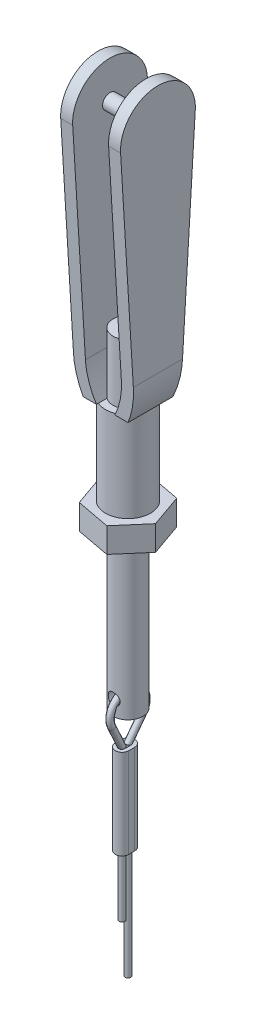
ISO-10303-21;
HEADER;
FILE_DESCRIPTION(('STEP AP214'),'2;1');
FILE_NAME('part.step','',(''),(''),'','','');
FILE_SCHEMA(('AUTOMOTIVE_DESIGN { 1 0 10303 214 1 1 1 1 }'));
ENDSEC;
DATA;
#1=APPLICATION_CONTEXT('core data for automotive mechanical design processes');
#2=APPLICATION_PROTOCOL_DEFINITION('international standard','automotive_design',2000,#1);
#3=PRODUCT_CONTEXT('',#1,'mechanical');
#4=PRODUCT('Part','Part','',(#3));
#5=PRODUCT_RELATED_PRODUCT_CATEGORY('part','',(#4));
#6=PRODUCT_DEFINITION_FORMATION('','',#4);
#7=PRODUCT_DEFINITION_CONTEXT('part definition',#1,'design');
#8=PRODUCT_DEFINITION('design','',#6,#7);
#9=PRODUCT_DEFINITION_SHAPE('','',#8);
#10=(LENGTH_UNIT() NAMED_UNIT(*) SI_UNIT(.MILLI.,.METRE.));
#11=(NAMED_UNIT(*) PLANE_ANGLE_UNIT() SI_UNIT($,.RADIAN.));
#12=(NAMED_UNIT(*) SI_UNIT($,.STERADIAN.) SOLID_ANGLE_UNIT());
#13=UNCERTAINTY_MEASURE_WITH_UNIT(LENGTH_MEASURE(1.E-05),#10,'distance_accuracy_value','');
#14=(GEOMETRIC_REPRESENTATION_CONTEXT(3) GLOBAL_UNCERTAINTY_ASSIGNED_CONTEXT((#13)) GLOBAL_UNIT_ASSIGNED_CONTEXT((#10,
#11,#12)) REPRESENTATION_CONTEXT('',''));
#15=CARTESIAN_POINT('',(0.,0.,0.));
#16=DIRECTION('',(0.,0.,1.));
#17=DIRECTION('',(1.,0.,0.));
#18=AXIS2_PLACEMENT_3D('',#15,#16,#17);
#19=CARTESIAN_POINT('',(1.50530229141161,-7.66,-1.75139896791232));
#20=DIRECTION('',(0.,-1.,0.));
#21=DIRECTION('',(0.,0.,-1.));
#22=AXIS2_PLACEMENT_3D('',#19,#20,#21);
#23=PLANE('',#22);
#24=DIRECTION('',(0.982682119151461,0.,0.185299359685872));
#25=VECTOR('',#24,1.);
#26=CARTESIAN_POINT('',(-0.764104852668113,-7.66,-2.17932950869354));
#27=LINE('',#26,#25);
#28=CARTESIAN_POINT('',(-0.764104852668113,-7.66,-2.17932950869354));
#29=VERTEX_POINT('',#28);
#30=CARTESIAN_POINT('',(1.50530229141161,-7.66,-1.75139896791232));
#31=VERTEX_POINT('',#30);
#32=EDGE_CURVE('E151',#29,#31,#27,.T.);
#33=ORIENTED_EDGE('',*,*,#32,.T.);
#34=DIRECTION('',(0.330867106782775,0.,0.943677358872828));
#35=VECTOR('',#34,1.);
#36=CARTESIAN_POINT('',(1.50530229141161,-7.66,-1.75139896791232));
#37=LINE('',#36,#35);
#38=CARTESIAN_POINT('',(2.26940714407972,-7.66,0.427930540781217));
#39=VERTEX_POINT('',#38);
#40=EDGE_CURVE('E109',#31,#39,#37,.T.);
#41=ORIENTED_EDGE('',*,*,#40,.T.);
#42=DIRECTION('',(-0.651815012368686,0.,0.758377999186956));
#43=VECTOR('',#42,1.);
#44=CARTESIAN_POINT('',(2.26940714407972,-7.66,0.427930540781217));
#45=LINE('',#44,#43);
#46=CARTESIAN_POINT('',(0.764104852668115,-7.66,2.17932950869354));
#47=VERTEX_POINT('',#46);
#48=EDGE_CURVE('E122',#39,#47,#45,.T.);
#49=ORIENTED_EDGE('',*,*,#48,.T.);
#50=DIRECTION('',(-0.982682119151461,0.,-0.185299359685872));
#51=VECTOR('',#50,1.);
#52=CARTESIAN_POINT('',(0.764104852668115,-7.66,2.17932950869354));
#53=LINE('',#52,#51);
#54=CARTESIAN_POINT('',(-1.5053022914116,-7.66,1.75139896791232));
#55=VERTEX_POINT('',#54);
#56=EDGE_CURVE('E116',#47,#55,#53,.T.);
#57=ORIENTED_EDGE('',*,*,#56,.T.);
#58=DIRECTION('',(-0.330867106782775,0.,-0.943677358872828));
#59=VECTOR('',#58,1.);
#60=CARTESIAN_POINT('',(-1.5053022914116,-7.66,1.75139896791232));
#61=LINE('',#60,#59);
#62=CARTESIAN_POINT('',(-2.26940714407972,-7.66,-0.427930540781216));
#63=VERTEX_POINT('',#62);
#64=EDGE_CURVE('E120',#55,#63,#61,.T.);
#65=ORIENTED_EDGE('',*,*,#64,.T.);
#66=DIRECTION('',(0.651815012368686,0.,-0.758377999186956));
#67=VECTOR('',#66,1.);
#68=CARTESIAN_POINT('',(-2.26940714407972,-7.66,-0.427930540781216));
#69=LINE('',#68,#67);
#70=EDGE_CURVE('E72',#63,#29,#69,.T.);
#71=ORIENTED_EDGE('',*,*,#70,.T.);
#72=EDGE_LOOP('',(#33,#41,#49,#57,#65,#71));
#73=FACE_BOUND('',#72,.T.);
#74=CARTESIAN_POINT('',(0.,-7.66,0.));
#75=DIRECTION('',(0.,-1.,0.));
#76=DIRECTION('',(0.,0.,-1.));
#77=AXIS2_PLACEMENT_3D('',#74,#75,#76);
#78=CIRCLE('',#77,1.);
#79=CARTESIAN_POINT('',(0.,-7.66,1.));
#80=VERTEX_POINT('',#79);
#81=EDGE_CURVE('E144',#80,#80,#78,.T.);
#82=ORIENTED_EDGE('',*,*,#81,.F.);
#83=EDGE_LOOP('',(#82));
#84=FACE_BOUND('',#83,.T.);
#85=ADVANCED_FACE('F55',(#73,#84),#23,.T.);
#86=CARTESIAN_POINT('',(1.50530229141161,-6.,-1.75139896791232));
#87=DIRECTION('',(0.,-1.,0.));
#88=DIRECTION('',(0.,0.,-1.));
#89=AXIS2_PLACEMENT_3D('',#86,#87,#88);
#90=PLANE('',#89);
#91=DIRECTION('',(0.982682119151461,0.,0.185299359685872));
#92=VECTOR('',#91,1.);
#93=CARTESIAN_POINT('',(-0.764104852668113,-6.,-2.17932950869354));
#94=LINE('',#93,#92);
#95=CARTESIAN_POINT('',(-0.764104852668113,-6.,-2.17932950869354));
#96=VERTEX_POINT('',#95);
#97=CARTESIAN_POINT('',(1.50530229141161,-6.,-1.75139896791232));
#98=VERTEX_POINT('',#97);
#99=EDGE_CURVE('E140',#96,#98,#94,.T.);
#100=ORIENTED_EDGE('',*,*,#99,.F.);
#101=DIRECTION('',(0.651815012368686,0.,-0.758377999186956));
#102=VECTOR('',#101,1.);
#103=CARTESIAN_POINT('',(-2.26940714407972,-6.,-0.427930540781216));
#104=LINE('',#103,#102);
#105=CARTESIAN_POINT('',(-2.26940714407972,-6.,-0.427930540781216));
#106=VERTEX_POINT('',#105);
#107=EDGE_CURVE('E101',#106,#96,#104,.T.);
#108=ORIENTED_EDGE('',*,*,#107,.F.);
#109=DIRECTION('',(-0.330867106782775,0.,-0.943677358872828));
#110=VECTOR('',#109,1.);
#111=CARTESIAN_POINT('',(-1.5053022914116,-6.,1.75139896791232));
#112=LINE('',#111,#110);
#113=CARTESIAN_POINT('',(-1.5053022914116,-6.,1.75139896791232));
#114=VERTEX_POINT('',#113);
#115=EDGE_CURVE('E95',#114,#106,#112,.T.);
#116=ORIENTED_EDGE('',*,*,#115,.F.);
#117=DIRECTION('',(-0.982682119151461,0.,-0.185299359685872));
#118=VECTOR('',#117,1.);
#119=CARTESIAN_POINT('',(0.764104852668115,-6.,2.17932950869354));
#120=LINE('',#119,#118);
#121=CARTESIAN_POINT('',(0.764104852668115,-6.,2.17932950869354));
#122=VERTEX_POINT('',#121);
#123=EDGE_CURVE('E130',#122,#114,#120,.T.);
#124=ORIENTED_EDGE('',*,*,#123,.F.);
#125=DIRECTION('',(-0.651815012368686,0.,0.758377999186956));
#126=VECTOR('',#125,1.);
#127=CARTESIAN_POINT('',(2.26940714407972,-6.,0.427930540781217));
#128=LINE('',#127,#126);
#129=CARTESIAN_POINT('',(2.26940714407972,-6.,0.427930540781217));
#130=VERTEX_POINT('',#129);
#131=EDGE_CURVE('E146',#130,#122,#128,.T.);
#132=ORIENTED_EDGE('',*,*,#131,.F.);
#133=DIRECTION('',(0.330867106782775,0.,0.943677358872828));
#134=VECTOR('',#133,1.);
#135=CARTESIAN_POINT('',(1.50530229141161,-6.,-1.75139896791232));
#136=LINE('',#135,#134);
#137=EDGE_CURVE('E143',#98,#130,#136,.T.);
#138=ORIENTED_EDGE('',*,*,#137,.F.);
#139=EDGE_LOOP('',(#100,#108,#116,#124,#132,#138));
#140=FACE_BOUND('',#139,.T.);
#141=CARTESIAN_POINT('',(0.,-6.,0.));
#142=DIRECTION('',(0.,-1.,0.));
#143=DIRECTION('',(0.,0.,-1.));
#144=AXIS2_PLACEMENT_3D('',#141,#142,#143);
#145=CIRCLE('',#144,1.);
#146=CARTESIAN_POINT('',(0.,-6.,1.));
#147=VERTEX_POINT('',#146);
#148=EDGE_CURVE('E244',#147,#147,#145,.T.);
#149=ORIENTED_EDGE('',*,*,#148,.T.);
#150=EDGE_LOOP('',(#149));
#151=FACE_BOUND('',#150,.T.);
#152=ADVANCED_FACE('F160',(#140,#151),#90,.F.);
#153=CARTESIAN_POINT('',(-0.764104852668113,-7.66,-2.17932950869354));
#154=DIRECTION('',(-0.185299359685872,0.,0.982682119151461));
#155=DIRECTION('',(0.982682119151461,0.,0.185299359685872));
#156=AXIS2_PLACEMENT_3D('',#153,#154,#155);
#157=PLANE('',#156);
#158=ORIENTED_EDGE('',*,*,#99,.T.);
#159=DIRECTION('',(0.,1.,0.));
#160=VECTOR('',#159,1.);
#161=CARTESIAN_POINT('',(1.50530229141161,-7.66,-1.75139896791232));
#162=LINE('',#161,#160);
#163=EDGE_CURVE('E13',#31,#98,#162,.T.);
#164=ORIENTED_EDGE('',*,*,#163,.F.);
#165=ORIENTED_EDGE('',*,*,#32,.F.);
#166=DIRECTION('',(0.,1.,0.));
#167=VECTOR('',#166,1.);
#168=CARTESIAN_POINT('',(-0.764104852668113,-7.66,-2.17932950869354));
#169=LINE('',#168,#167);
#170=EDGE_CURVE('E136',#29,#96,#169,.T.);
#171=ORIENTED_EDGE('',*,*,#170,.T.);
#172=EDGE_LOOP('',(#158,#164,#165,#171));
#173=FACE_BOUND('',#172,.T.);
#174=ADVANCED_FACE('F57',(#173),#157,.F.);
#175=CARTESIAN_POINT('',(1.50530229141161,-7.66,-1.75139896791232));
#176=DIRECTION('',(-0.943677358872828,0.,0.330867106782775));
#177=DIRECTION('',(0.330867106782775,0.,0.943677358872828));
#178=AXIS2_PLACEMENT_3D('',#175,#176,#177);
#179=PLANE('',#178);
#180=ORIENTED_EDGE('',*,*,#137,.T.);
#181=DIRECTION('',(0.,1.,0.));
#182=VECTOR('',#181,1.);
#183=CARTESIAN_POINT('',(2.26940714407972,-7.66,0.427930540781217));
#184=LINE('',#183,#182);
#185=EDGE_CURVE('E64',#39,#130,#184,.T.);
#186=ORIENTED_EDGE('',*,*,#185,.F.);
#187=ORIENTED_EDGE('',*,*,#40,.F.);
#188=ORIENTED_EDGE('',*,*,#163,.T.);
#189=EDGE_LOOP('',(#180,#186,#187,#188));
#190=FACE_BOUND('',#189,.T.);
#191=ADVANCED_FACE('F185',(#190),#179,.F.);
#192=CARTESIAN_POINT('',(2.26940714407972,-7.66,0.427930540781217));
#193=DIRECTION('',(-0.758377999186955,0.,-0.651815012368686));
#194=DIRECTION('',(-0.651815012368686,0.,0.758377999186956));
#195=AXIS2_PLACEMENT_3D('',#192,#193,#194);
#196=PLANE('',#195);
#197=ORIENTED_EDGE('',*,*,#131,.T.);
#198=DIRECTION('',(0.,1.,0.));
#199=VECTOR('',#198,1.);
#200=CARTESIAN_POINT('',(0.764104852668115,-7.66,2.17932950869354));
#201=LINE('',#200,#199);
#202=EDGE_CURVE('E131',#47,#122,#201,.T.);
#203=ORIENTED_EDGE('',*,*,#202,.F.);
#204=ORIENTED_EDGE('',*,*,#48,.F.);
#205=ORIENTED_EDGE('',*,*,#185,.T.);
#206=EDGE_LOOP('',(#197,#203,#204,#205));
#207=FACE_BOUND('',#206,.T.);
#208=ADVANCED_FACE('F157',(#207),#196,.F.);
#209=CARTESIAN_POINT('',(0.764104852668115,-7.66,2.17932950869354));
#210=DIRECTION('',(0.185299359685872,0.,-0.982682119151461));
#211=DIRECTION('',(-0.982682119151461,0.,-0.185299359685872));
#212=AXIS2_PLACEMENT_3D('',#209,#210,#211);
#213=PLANE('',#212);
#214=ORIENTED_EDGE('',*,*,#123,.T.);
#215=DIRECTION('',(0.,1.,0.));
#216=VECTOR('',#215,1.);
#217=CARTESIAN_POINT('',(-1.5053022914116,-7.66,1.75139896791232));
#218=LINE('',#217,#216);
#219=EDGE_CURVE('E127',#55,#114,#218,.T.);
#220=ORIENTED_EDGE('',*,*,#219,.F.);
#221=ORIENTED_EDGE('',*,*,#56,.F.);
#222=ORIENTED_EDGE('',*,*,#202,.T.);
#223=EDGE_LOOP('',(#214,#220,#221,#222));
#224=FACE_BOUND('',#223,.T.);
#225=ADVANCED_FACE('F128',(#224),#213,.F.);
#226=CARTESIAN_POINT('',(-1.5053022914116,-7.66,1.75139896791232));
#227=DIRECTION('',(0.943677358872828,0.,-0.330867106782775));
#228=DIRECTION('',(-0.330867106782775,0.,-0.943677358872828));
#229=AXIS2_PLACEMENT_3D('',#226,#227,#228);
#230=PLANE('',#229);
#231=ORIENTED_EDGE('',*,*,#115,.T.);
#232=DIRECTION('',(0.,1.,0.));
#233=VECTOR('',#232,1.);
#234=CARTESIAN_POINT('',(-2.26940714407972,-7.66,-0.427930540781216));
#235=LINE('',#234,#233);
#236=EDGE_CURVE('E132',#63,#106,#235,.T.);
#237=ORIENTED_EDGE('',*,*,#236,.F.);
#238=ORIENTED_EDGE('',*,*,#64,.F.);
#239=ORIENTED_EDGE('',*,*,#219,.T.);
#240=EDGE_LOOP('',(#231,#237,#238,#239));
#241=FACE_BOUND('',#240,.T.);
#242=ADVANCED_FACE('F134',(#241),#230,.F.);
#243=CARTESIAN_POINT('',(-2.26940714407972,-7.66,-0.427930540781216));
#244=DIRECTION('',(0.758377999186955,0.,0.651815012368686));
#245=DIRECTION('',(0.651815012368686,0.,-0.758377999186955));
#246=AXIS2_PLACEMENT_3D('',#243,#244,#245);
#247=PLANE('',#246);
#248=ORIENTED_EDGE('',*,*,#107,.T.);
#249=ORIENTED_EDGE('',*,*,#170,.F.);
#250=ORIENTED_EDGE('',*,*,#70,.F.);
#251=ORIENTED_EDGE('',*,*,#236,.T.);
#252=EDGE_LOOP('',(#248,#249,#250,#251));
#253=FACE_BOUND('',#252,.T.);
#254=ADVANCED_FACE('F165',(#253),#247,.F.);
#255=CARTESIAN_POINT('',(0.,-7.66,0.));
#256=DIRECTION('',(0.,1.,0.));
#257=DIRECTION('',(0.,0.,1.));
#258=AXIS2_PLACEMENT_3D('',#255,#256,#257);
#259=CYLINDRICAL_SURFACE('',#258,1.);
#260=CARTESIAN_POINT('',(0.,-7.66,1.));
#261=CARTESIAN_POINT('',(0.,-7.64270833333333,1.));
#262=CARTESIAN_POINT('',(0.,-7.62541666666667,1.));
#263=CARTESIAN_POINT('',(0.,-7.59083333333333,1.));
#264=CARTESIAN_POINT('',(0.,-7.57354166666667,1.));
#265=CARTESIAN_POINT('',(0.,-7.53895833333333,1.));
#266=CARTESIAN_POINT('',(0.,-7.52166666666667,1.));
#267=CARTESIAN_POINT('',(0.,-7.48708333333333,1.));
#268=CARTESIAN_POINT('',(0.,-7.46979166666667,1.));
#269=CARTESIAN_POINT('',(0.,-7.43520833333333,1.));
#270=CARTESIAN_POINT('',(0.,-7.41791666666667,1.));
#271=CARTESIAN_POINT('',(0.,-7.38333333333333,1.));
#272=CARTESIAN_POINT('',(0.,-7.36604166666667,1.));
#273=CARTESIAN_POINT('',(0.,-7.33145833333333,1.));
#274=CARTESIAN_POINT('',(0.,-7.31416666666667,1.));
#275=CARTESIAN_POINT('',(0.,-7.27958333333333,1.));
#276=CARTESIAN_POINT('',(0.,-7.26229166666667,1.));
#277=CARTESIAN_POINT('',(0.,-7.22770833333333,1.));
#278=CARTESIAN_POINT('',(0.,-7.21041666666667,1.));
#279=CARTESIAN_POINT('',(0.,-7.17583333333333,1.));
#280=CARTESIAN_POINT('',(0.,-7.15854166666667,1.));
#281=CARTESIAN_POINT('',(0.,-7.12395833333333,1.));
#282=CARTESIAN_POINT('',(0.,-7.10666666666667,1.));
#283=CARTESIAN_POINT('',(0.,-7.07208333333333,1.));
#284=CARTESIAN_POINT('',(0.,-7.05479166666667,1.));
#285=CARTESIAN_POINT('',(0.,-7.02020833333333,1.));
#286=CARTESIAN_POINT('',(0.,-7.00291666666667,1.));
#287=CARTESIAN_POINT('',(0.,-6.96833333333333,1.));
#288=CARTESIAN_POINT('',(0.,-6.95104166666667,1.));
#289=CARTESIAN_POINT('',(0.,-6.91645833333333,1.));
#290=CARTESIAN_POINT('',(0.,-6.89916666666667,1.));
#291=CARTESIAN_POINT('',(0.,-6.86458333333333,1.));
#292=CARTESIAN_POINT('',(0.,-6.84729166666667,1.));
#293=CARTESIAN_POINT('',(0.,-6.81270833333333,1.));
#294=CARTESIAN_POINT('',(0.,-6.79541666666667,1.));
#295=CARTESIAN_POINT('',(0.,-6.76083333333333,1.));
#296=CARTESIAN_POINT('',(0.,-6.74354166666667,1.));
#297=CARTESIAN_POINT('',(0.,-6.70895833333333,1.));
#298=CARTESIAN_POINT('',(0.,-6.69166666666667,1.));
#299=CARTESIAN_POINT('',(0.,-6.65708333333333,1.));
#300=CARTESIAN_POINT('',(0.,-6.63979166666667,1.));
#301=CARTESIAN_POINT('',(0.,-6.60520833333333,1.));
#302=CARTESIAN_POINT('',(0.,-6.58791666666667,1.));
#303=CARTESIAN_POINT('',(0.,-6.55333333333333,1.));
#304=CARTESIAN_POINT('',(0.,-6.53604166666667,1.));
#305=CARTESIAN_POINT('',(0.,-6.50145833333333,1.));
#306=CARTESIAN_POINT('',(0.,-6.48416666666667,1.));
#307=CARTESIAN_POINT('',(0.,-6.44958333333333,1.));
#308=CARTESIAN_POINT('',(0.,-6.43229166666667,1.));
#309=CARTESIAN_POINT('',(0.,-6.39770833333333,1.));
#310=CARTESIAN_POINT('',(0.,-6.38041666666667,1.));
#311=CARTESIAN_POINT('',(0.,-6.34583333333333,1.));
#312=CARTESIAN_POINT('',(0.,-6.32854166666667,1.));
#313=CARTESIAN_POINT('',(0.,-6.29395833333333,1.));
#314=CARTESIAN_POINT('',(0.,-6.27666666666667,1.));
#315=CARTESIAN_POINT('',(0.,-6.24208333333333,1.));
#316=CARTESIAN_POINT('',(0.,-6.22479166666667,1.));
#317=CARTESIAN_POINT('',(0.,-6.19020833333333,1.));
#318=CARTESIAN_POINT('',(0.,-6.17291666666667,1.));
#319=CARTESIAN_POINT('',(0.,-6.13833333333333,1.));
#320=CARTESIAN_POINT('',(0.,-6.12104166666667,1.));
#321=CARTESIAN_POINT('',(0.,-6.08645833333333,1.));
#322=CARTESIAN_POINT('',(0.,-6.06916666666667,1.));
#323=CARTESIAN_POINT('',(0.,-6.03458333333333,1.));
#324=CARTESIAN_POINT('',(0.,-6.01729166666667,1.));
#325=CARTESIAN_POINT('',(0.,-6.,1.));
#326=B_SPLINE_CURVE_WITH_KNOTS('',3,(#260,#261,#262,#263,#264,#265,#266,#267,#268,#269,#270,
#271,#272,#273,#274,#275,#276,#277,#278,#279,#280,#281,#282,#283,#284,#285,#286,#287,#288,#289,
#290,#291,#292,#293,#294,#295,#296,#297,#298,#299,#300,#301,#302,#303,#304,#305,#306,#307,#308,
#309,#310,#311,#312,#313,#314,#315,#316,#317,#318,#319,#320,#321,#322,#323,#324,#325),
.UNSPECIFIED.,.F.,.F.,(4,2,2,2,2,2,2,2,2,2,2,2,2,2,2,2,2,2,2,2,2,2,2,2,2,2,2,2,2,2,2,2,4),(0.,
0.0518749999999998,0.10375,0.155625,0.207499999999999,0.259374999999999,0.31125,0.363125,0.415,
0.466874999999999,0.518749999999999,0.570625,0.6225,0.674375,0.72625,0.778124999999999,0.83,
0.881875,0.93375,0.985625,1.0375,1.089375,1.14125,1.193125,1.245,1.296875,1.34875,1.400625,
1.4525,1.504375,1.55625,1.608125,1.66),.UNSPECIFIED.);
#327=EDGE_CURVE('BSEAM167',#80,#147,#326,.T.);
#328=ORIENTED_EDGE('',*,*,#81,.T.);
#329=ORIENTED_EDGE('',*,*,#148,.F.);
#330=ORIENTED_EDGE('',*,*,#327,.T.);
#331=ORIENTED_EDGE('',*,*,#327,.F.);
#332=EDGE_LOOP('',(#328,#330,#329,#331));
#333=FACE_BOUND('',#332,.T.);
#334=ADVANCED_FACE('F167',(#333),#259,.F.);
#335=CLOSED_SHELL('',(#85,#152,#174,#191,#208,#225,#242,#254,#334));
#336=MANIFOLD_SOLID_BREP('B2',#335);
#337=CARTESIAN_POINT('',(0.,-26.063324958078,0.4));
#338=DIRECTION('',(0.,-1.,0.));
#339=DIRECTION('',(1.,0.,0.));
#340=AXIS2_PLACEMENT_3D('',#337,#338,#339);
#341=PLANE('',#340);
#342=CARTESIAN_POINT('',(0.,-26.063324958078,0.4));
#343=DIRECTION('',(0.,-1.,0.));
#344=DIRECTION('',(1.,0.,0.));
#345=AXIS2_PLACEMENT_3D('',#342,#343,#344);
#346=CIRCLE('',#345,0.449999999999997);
#347=CARTESIAN_POINT('',(0.450000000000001,-26.063324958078,0.4));
#348=VERTEX_POINT('',#347);
#349=CARTESIAN_POINT('',(-0.449999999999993,-26.063324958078,0.4));
#350=VERTEX_POINT('',#349);
#351=EDGE_CURVE('E363',#348,#350,#346,.T.);
#352=ORIENTED_EDGE('',*,*,#351,.T.);
#353=DIRECTION('',(0.,0.,-1.));
#354=VECTOR('',#353,1.);
#355=CARTESIAN_POINT('',(-0.449999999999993,-26.063324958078,0.4));
#356=LINE('',#355,#354);
#357=CARTESIAN_POINT('',(-0.449999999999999,-26.063324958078,0.));
#358=VERTEX_POINT('',#357);
#359=EDGE_CURVE('E366',#350,#358,#356,.T.);
#360=ORIENTED_EDGE('',*,*,#359,.T.);
#361=CARTESIAN_POINT('',(0.,-26.063324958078,0.));
#362=DIRECTION('',(0.,-1.,0.));
#363=DIRECTION('',(1.,0.,0.));
#364=AXIS2_PLACEMENT_3D('',#361,#362,#363);
#365=CIRCLE('',#364,0.45);
#366=CARTESIAN_POINT('',(0.450000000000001,-26.063324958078,0.));
#367=VERTEX_POINT('',#366);
#368=EDGE_CURVE('E369',#358,#367,#365,.T.);
#369=ORIENTED_EDGE('',*,*,#368,.T.);
#370=DIRECTION('',(0.,0.,1.));
#371=VECTOR('',#370,1.);
#372=CARTESIAN_POINT('',(0.450000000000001,-26.063324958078,0.4));
#373=LINE('',#372,#371);
#374=EDGE_CURVE('E371',#367,#348,#373,.T.);
#375=ORIENTED_EDGE('',*,*,#374,.T.);
#376=EDGE_LOOP('',(#352,#360,#369,#375));
#377=FACE_BOUND('',#376,.T.);
#378=DIRECTION('',(0.,0.,-1.));
#379=VECTOR('',#378,1.);
#380=CARTESIAN_POINT('',(-0.199999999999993,-26.063324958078,0.4));
#381=LINE('',#380,#379);
#382=CARTESIAN_POINT('',(-0.199999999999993,-26.063324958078,0.4));
#383=VERTEX_POINT('',#382);
#384=CARTESIAN_POINT('',(-0.199999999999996,-26.063324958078,0.));
#385=VERTEX_POINT('',#384);
#386=EDGE_CURVE('E335',#383,#385,#381,.T.);
#387=ORIENTED_EDGE('',*,*,#386,.F.);
#388=CARTESIAN_POINT('',(0.,-26.063324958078,0.4));
#389=DIRECTION('',(0.,-1.,0.));
#390=DIRECTION('',(1.,0.,0.));
#391=AXIS2_PLACEMENT_3D('',#388,#389,#390);
#392=CIRCLE('',#391,0.199999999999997);
#393=CARTESIAN_POINT('',(0.200000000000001,-26.063324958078,0.4));
#394=VERTEX_POINT('',#393);
#395=EDGE_CURVE('E327',#394,#383,#392,.T.);
#396=ORIENTED_EDGE('',*,*,#395,.F.);
#397=DIRECTION('',(0.,0.,1.));
#398=VECTOR('',#397,1.);
#399=CARTESIAN_POINT('',(0.200000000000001,-26.063324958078,0.4));
#400=LINE('',#399,#398);
#401=CARTESIAN_POINT('',(0.200000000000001,-26.063324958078,0.));
#402=VERTEX_POINT('',#401);
#403=EDGE_CURVE('E349',#402,#394,#400,.T.);
#404=ORIENTED_EDGE('',*,*,#403,.F.);
#405=CARTESIAN_POINT('',(0.,-26.063324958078,0.));
#406=DIRECTION('',(0.,-1.,0.));
#407=DIRECTION('',(1.,0.,0.));
#408=AXIS2_PLACEMENT_3D('',#405,#406,#407);
#409=CIRCLE('',#408,0.199999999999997);
#410=EDGE_CURVE('E347',#385,#402,#409,.T.);
#411=ORIENTED_EDGE('',*,*,#410,.F.);
#412=EDGE_LOOP('',(#387,#396,#404,#411));
#413=FACE_BOUND('',#412,.T.);
#414=ADVANCED_FACE('F262',(#377,#413),#341,.T.);
#415=CARTESIAN_POINT('',(0.,-20.063324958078,0.4));
#416=DIRECTION('',(0.,-1.,0.));
#417=DIRECTION('',(1.,0.,0.));
#418=AXIS2_PLACEMENT_3D('',#415,#416,#417);
#419=PLANE('',#418);
#420=CARTESIAN_POINT('',(0.,-20.063324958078,0.4));
#421=DIRECTION('',(0.,-1.,0.));
#422=DIRECTION('',(1.,0.,0.));
#423=AXIS2_PLACEMENT_3D('',#420,#421,#422);
#424=CIRCLE('',#423,0.449999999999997);
#425=CARTESIAN_POINT('',(0.45,-20.063324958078,0.4));
#426=VERTEX_POINT('',#425);
#427=CARTESIAN_POINT('',(-0.449999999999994,-20.063324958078,0.4));
#428=VERTEX_POINT('',#427);
#429=EDGE_CURVE('E343',#426,#428,#424,.T.);
#430=ORIENTED_EDGE('',*,*,#429,.F.);
#431=DIRECTION('',(0.,0.,1.));
#432=VECTOR('',#431,1.);
#433=CARTESIAN_POINT('',(0.45,-20.063324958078,0.4));
#434=LINE('',#433,#432);
#435=CARTESIAN_POINT('',(0.45,-20.063324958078,0.));
#436=VERTEX_POINT('',#435);
#437=EDGE_CURVE('E367',#436,#426,#434,.T.);
#438=ORIENTED_EDGE('',*,*,#437,.F.);
#439=CARTESIAN_POINT('',(0.,-20.063324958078,0.));
#440=DIRECTION('',(0.,-1.,0.));
#441=DIRECTION('',(1.,0.,0.));
#442=AXIS2_PLACEMENT_3D('',#439,#440,#441);
#443=CIRCLE('',#442,0.45);
#444=CARTESIAN_POINT('',(-0.45,-20.063324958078,0.));
#445=VERTEX_POINT('',#444);
#446=EDGE_CURVE('E378',#445,#436,#443,.T.);
#447=ORIENTED_EDGE('',*,*,#446,.F.);
#448=DIRECTION('',(0.,0.,-1.));
#449=VECTOR('',#448,1.);
#450=CARTESIAN_POINT('',(-0.449999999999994,-20.063324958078,0.4));
#451=LINE('',#450,#449);
#452=EDGE_CURVE('E376',#428,#445,#451,.T.);
#453=ORIENTED_EDGE('',*,*,#452,.F.);
#454=EDGE_LOOP('',(#430,#438,#447,#453));
#455=FACE_BOUND('',#454,.T.);
#456=CARTESIAN_POINT('',(0.,-20.063324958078,0.4));
#457=DIRECTION('',(0.,-1.,0.));
#458=DIRECTION('',(1.,0.,0.));
#459=AXIS2_PLACEMENT_3D('',#456,#457,#458);
#460=CIRCLE('',#459,0.199999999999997);
#461=CARTESIAN_POINT('',(0.2,-20.063324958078,0.4));
#462=VERTEX_POINT('',#461);
#463=CARTESIAN_POINT('',(-0.199999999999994,-20.063324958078,0.4));
#464=VERTEX_POINT('',#463);
#465=EDGE_CURVE('E285',#462,#464,#460,.T.);
#466=ORIENTED_EDGE('',*,*,#465,.T.);
#467=DIRECTION('',(0.,0.,-1.));
#468=VECTOR('',#467,1.);
#469=CARTESIAN_POINT('',(-0.199999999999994,-20.063324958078,0.4));
#470=LINE('',#469,#468);
#471=CARTESIAN_POINT('',(-0.199999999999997,-20.063324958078,0.));
#472=VERTEX_POINT('',#471);
#473=EDGE_CURVE('E342',#464,#472,#470,.T.);
#474=ORIENTED_EDGE('',*,*,#473,.T.);
#475=CARTESIAN_POINT('',(0.,-20.063324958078,0.));
#476=DIRECTION('',(0.,-1.,0.));
#477=DIRECTION('',(1.,0.,0.));
#478=AXIS2_PLACEMENT_3D('',#475,#476,#477);
#479=CIRCLE('',#478,0.199999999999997);
#480=CARTESIAN_POINT('',(0.2,-20.063324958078,0.));
#481=VERTEX_POINT('',#480);
#482=EDGE_CURVE('E355',#472,#481,#479,.T.);
#483=ORIENTED_EDGE('',*,*,#482,.T.);
#484=DIRECTION('',(0.,0.,1.));
#485=VECTOR('',#484,1.);
#486=CARTESIAN_POINT('',(0.2,-20.063324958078,0.4));
#487=LINE('',#486,#485);
#488=EDGE_CURVE('E336',#481,#462,#487,.T.);
#489=ORIENTED_EDGE('',*,*,#488,.T.);
#490=EDGE_LOOP('',(#466,#474,#483,#489));
#491=FACE_BOUND('',#490,.T.);
#492=ADVANCED_FACE('F396',(#455,#491),#419,.F.);
#493=CARTESIAN_POINT('',(0.,-26.063324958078,0.4));
#494=DIRECTION('',(0.,1.,0.));
#495=DIRECTION('',(-1.,0.,0.));
#496=AXIS2_PLACEMENT_3D('',#493,#494,#495);
#497=CYLINDRICAL_SURFACE('',#496,0.449999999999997);
#498=ORIENTED_EDGE('',*,*,#429,.T.);
#499=DIRECTION('',(0.,1.,0.));
#500=VECTOR('',#499,1.);
#501=CARTESIAN_POINT('',(-0.449999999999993,-26.063324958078,0.4));
#502=LINE('',#501,#500);
#503=EDGE_CURVE('E53',#350,#428,#502,.T.);
#504=ORIENTED_EDGE('',*,*,#503,.F.);
#505=ORIENTED_EDGE('',*,*,#351,.F.);
#506=DIRECTION('',(0.,1.,0.));
#507=VECTOR('',#506,1.);
#508=CARTESIAN_POINT('',(0.450000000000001,-26.063324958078,0.4));
#509=LINE('',#508,#507);
#510=EDGE_CURVE('E373',#348,#426,#509,.T.);
#511=ORIENTED_EDGE('',*,*,#510,.T.);
#512=EDGE_LOOP('',(#498,#504,#505,#511));
#513=FACE_BOUND('',#512,.T.);
#514=ADVANCED_FACE('F264',(#513),#497,.T.);
#515=CARTESIAN_POINT('',(-0.449999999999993,-26.063324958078,0.4));
#516=DIRECTION('',(1.,0.,0.));
#517=DIRECTION('',(0.,0.,-1.));
#518=AXIS2_PLACEMENT_3D('',#515,#516,#517);
#519=PLANE('',#518);
#520=ORIENTED_EDGE('',*,*,#452,.T.);
#521=DIRECTION('',(0.,1.,0.));
#522=VECTOR('',#521,1.);
#523=CARTESIAN_POINT('',(-0.449999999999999,-26.063324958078,0.));
#524=LINE('',#523,#522);
#525=EDGE_CURVE('E270',#358,#445,#524,.T.);
#526=ORIENTED_EDGE('',*,*,#525,.F.);
#527=ORIENTED_EDGE('',*,*,#359,.F.);
#528=ORIENTED_EDGE('',*,*,#503,.T.);
#529=EDGE_LOOP('',(#520,#526,#527,#528));
#530=FACE_BOUND('',#529,.T.);
#531=ADVANCED_FACE('F406',(#530),#519,.F.);
#532=CARTESIAN_POINT('',(0.,-26.063324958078,0.));
#533=DIRECTION('',(0.,1.,0.));
#534=DIRECTION('',(-1.,0.,0.));
#535=AXIS2_PLACEMENT_3D('',#532,#533,#534);
#536=CYLINDRICAL_SURFACE('',#535,0.45);
#537=ORIENTED_EDGE('',*,*,#446,.T.);
#538=DIRECTION('',(0.,1.,0.));
#539=VECTOR('',#538,1.);
#540=CARTESIAN_POINT('',(0.450000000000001,-26.063324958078,0.));
#541=LINE('',#540,#539);
#542=EDGE_CURVE('E383',#367,#436,#541,.T.);
#543=ORIENTED_EDGE('',*,*,#542,.F.);
#544=ORIENTED_EDGE('',*,*,#368,.F.);
#545=ORIENTED_EDGE('',*,*,#525,.T.);
#546=EDGE_LOOP('',(#537,#543,#544,#545));
#547=FACE_BOUND('',#546,.T.);
#548=ADVANCED_FACE('F390',(#547),#536,.T.);
#549=CARTESIAN_POINT('',(0.450000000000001,-26.063324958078,0.4));
#550=DIRECTION('',(-1.,0.,0.));
#551=DIRECTION('',(0.,-1.,0.));
#552=AXIS2_PLACEMENT_3D('',#549,#550,#551);
#553=PLANE('',#552);
#554=ORIENTED_EDGE('',*,*,#437,.T.);
#555=ORIENTED_EDGE('',*,*,#510,.F.);
#556=ORIENTED_EDGE('',*,*,#374,.F.);
#557=ORIENTED_EDGE('',*,*,#542,.T.);
#558=EDGE_LOOP('',(#554,#555,#556,#557));
#559=FACE_BOUND('',#558,.T.);
#560=ADVANCED_FACE('F400',(#559),#553,.F.);
#561=CARTESIAN_POINT('',(0.,-26.063324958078,0.4));
#562=DIRECTION('',(0.,1.,0.));
#563=DIRECTION('',(-1.,0.,0.));
#564=AXIS2_PLACEMENT_3D('',#561,#562,#563);
#565=CYLINDRICAL_SURFACE('',#564,0.199999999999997);
#566=ORIENTED_EDGE('',*,*,#465,.F.);
#567=DIRECTION('',(0.,1.,0.));
#568=VECTOR('',#567,1.);
#569=CARTESIAN_POINT('',(0.200000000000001,-26.063324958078,0.4));
#570=LINE('',#569,#568);
#571=EDGE_CURVE('E331',#394,#462,#570,.T.);
#572=ORIENTED_EDGE('',*,*,#571,.F.);
#573=ORIENTED_EDGE('',*,*,#395,.T.);
#574=DIRECTION('',(0.,1.,0.));
#575=VECTOR('',#574,1.);
#576=CARTESIAN_POINT('',(-0.199999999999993,-26.063324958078,0.4));
#577=LINE('',#576,#575);
#578=EDGE_CURVE('E330',#383,#464,#577,.T.);
#579=ORIENTED_EDGE('',*,*,#578,.T.);
#580=EDGE_LOOP('',(#566,#572,#573,#579));
#581=FACE_BOUND('',#580,.T.);
#582=ADVANCED_FACE('F329',(#581),#565,.F.);
#583=CARTESIAN_POINT('',(-0.199999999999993,-26.063324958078,0.4));
#584=DIRECTION('',(1.,0.,0.));
#585=DIRECTION('',(0.,1.,0.));
#586=AXIS2_PLACEMENT_3D('',#583,#584,#585);
#587=PLANE('',#586);
#588=ORIENTED_EDGE('',*,*,#473,.F.);
#589=ORIENTED_EDGE('',*,*,#578,.F.);
#590=ORIENTED_EDGE('',*,*,#386,.T.);
#591=DIRECTION('',(0.,1.,0.));
#592=VECTOR('',#591,1.);
#593=CARTESIAN_POINT('',(-0.199999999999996,-26.063324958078,0.));
#594=LINE('',#593,#592);
#595=EDGE_CURVE('E344',#385,#472,#594,.T.);
#596=ORIENTED_EDGE('',*,*,#595,.T.);
#597=EDGE_LOOP('',(#588,#589,#590,#596));
#598=FACE_BOUND('',#597,.T.);
#599=ADVANCED_FACE('F339',(#598),#587,.T.);
#600=CARTESIAN_POINT('',(0.,-26.063324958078,0.));
#601=DIRECTION('',(0.,1.,0.));
#602=DIRECTION('',(-1.,0.,0.));
#603=AXIS2_PLACEMENT_3D('',#600,#601,#602);
#604=CYLINDRICAL_SURFACE('',#603,0.199999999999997);
#605=ORIENTED_EDGE('',*,*,#482,.F.);
#606=ORIENTED_EDGE('',*,*,#595,.F.);
#607=ORIENTED_EDGE('',*,*,#410,.T.);
#608=DIRECTION('',(0.,1.,0.));
#609=VECTOR('',#608,1.);
#610=CARTESIAN_POINT('',(0.200000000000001,-26.063324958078,0.));
#611=LINE('',#610,#609);
#612=EDGE_CURVE('E277',#402,#481,#611,.T.);
#613=ORIENTED_EDGE('',*,*,#612,.T.);
#614=EDGE_LOOP('',(#605,#606,#607,#613));
#615=FACE_BOUND('',#614,.T.);
#616=ADVANCED_FACE('F429',(#615),#604,.F.);
#617=CARTESIAN_POINT('',(0.200000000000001,-26.063324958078,0.4));
#618=DIRECTION('',(-1.,0.,0.));
#619=DIRECTION('',(0.,-1.,0.));
#620=AXIS2_PLACEMENT_3D('',#617,#618,#619);
#621=PLANE('',#620);
#622=ORIENTED_EDGE('',*,*,#488,.F.);
#623=ORIENTED_EDGE('',*,*,#612,.F.);
#624=ORIENTED_EDGE('',*,*,#403,.T.);
#625=ORIENTED_EDGE('',*,*,#571,.T.);
#626=EDGE_LOOP('',(#622,#623,#624,#625));
#627=FACE_BOUND('',#626,.T.);
#628=ADVANCED_FACE('F433',(#627),#621,.T.);
#629=CLOSED_SHELL('',(#414,#492,#514,#531,#548,#560,#582,#599,#616,#628));
#630=MANIFOLD_SOLID_BREP('B7',#629);
#631=CARTESIAN_POINT('',(0.,-20.063324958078,0.));
#632=DIRECTION('',(0.,-1.,0.));
#633=DIRECTION('',(0.,0.,-1.));
#634=AXIS2_PLACEMENT_3D('',#631,#632,#633);
#635=CYLINDRICAL_SURFACE('',#634,0.2);
#636=CARTESIAN_POINT('',(0.,-20.063324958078,0.));
#637=DIRECTION('',(0.,-0.948683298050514,0.316227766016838));
#638=DIRECTION('',(0.,0.316227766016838,0.948683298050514));
#639=AXIS2_PLACEMENT_3D('',#636,#637,#638);
#640=ELLIPSE('',#639,0.210818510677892,0.2);
#641=CARTESIAN_POINT('',(0.,-19.9966582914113,0.200000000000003));
#642=VERTEX_POINT('',#641);
#643=EDGE_CURVE('E508',#642,#642,#640,.F.);
#644=ORIENTED_EDGE('',*,*,#643,.F.);
#645=EDGE_LOOP('',(#644));
#646=FACE_BOUND('',#645,.T.);
#647=CARTESIAN_POINT('',(0.,-33.5,0.));
#648=DIRECTION('',(0.,-1.,0.));
#649=DIRECTION('',(0.,0.,-1.));
#650=AXIS2_PLACEMENT_3D('',#647,#648,#649);
#651=CIRCLE('',#650,0.2);
#652=CARTESIAN_POINT('',(0.,-33.5,-0.199999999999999));
#653=VERTEX_POINT('',#652);
#654=EDGE_CURVE('E261',#653,#653,#651,.T.);
#655=ORIENTED_EDGE('',*,*,#654,.F.);
#656=EDGE_LOOP('',(#655));
#657=FACE_BOUND('',#656,.T.);
#658=ADVANCED_FACE('F502',(#646,#657),#635,.T.);
#659=CARTESIAN_POINT('',(0.,-18.783324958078,-0.959999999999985));
#660=DIRECTION('',(0.,-0.8,0.599999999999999));
#661=DIRECTION('',(0.,-0.6,-0.800000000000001));
#662=AXIS2_PLACEMENT_3D('',#659,#660,#661);
#663=CYLINDRICAL_SURFACE('',#662,0.2);
#664=CARTESIAN_POINT('',(0.,-18.783324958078,-0.959999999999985));
#665=DIRECTION('',(0.,-0.799999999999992,0.600000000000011));
#666=DIRECTION('',(0.,-0.600000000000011,-0.799999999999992));
#667=AXIS2_PLACEMENT_3D('',#664,#665,#666);
#668=CIRCLE('',#667,0.2);
#669=CARTESIAN_POINT('',(0.,-18.903324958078,-1.11999999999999));
#670=VERTEX_POINT('',#669);
#671=EDGE_CURVE('E512',#670,#670,#668,.T.);
#672=ORIENTED_EDGE('',*,*,#671,.T.);
#673=EDGE_LOOP('',(#672));
#674=FACE_BOUND('',#673,.T.);
#675=ORIENTED_EDGE('',*,*,#643,.T.);
#676=EDGE_LOOP('',(#675));
#677=FACE_BOUND('',#676,.T.);
#678=ADVANCED_FACE('F546',(#674,#677),#663,.T.);
#679=CARTESIAN_POINT('',(0.,-18.063324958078,0.));
#680=DIRECTION('',(-1.,0.,0.));
#681=DIRECTION('',(0.,0.,1.));
#682=AXIS2_PLACEMENT_3D('',#679,#680,#681);
#683=TOROIDAL_SURFACE('',#682,1.2,0.2);
#684=CARTESIAN_POINT('',(0.,-18.5653354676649,1.08994745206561));
#685=DIRECTION('',(0.,0.908289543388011,0.418342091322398));
#686=DIRECTION('',(0.,-0.418342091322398,0.908289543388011));
#687=AXIS2_PLACEMENT_3D('',#684,#685,#686);
#688=CIRCLE('',#687,0.2);
#689=CARTESIAN_POINT('',(0.,-18.6490038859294,1.27160536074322));
#690=VERTEX_POINT('',#689);
#691=EDGE_CURVE('E516',#690,#690,#688,.T.);
#692=CARTESIAN_POINT('',(0.,-18.063324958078,0.));
#693=DIRECTION('',(-1.,0.,0.));
#694=DIRECTION('',(0.,0.,1.));
#695=AXIS2_PLACEMENT_3D('',#692,#693,#694);
#696=CIRCLE('',#695,1.4);
#697=EDGE_CURVE('',#690,#670,#696,.T.);
#698=ORIENTED_EDGE('',*,*,#691,.T.);
#699=ORIENTED_EDGE('',*,*,#671,.F.);
#700=ORIENTED_EDGE('',*,*,#697,.T.);
#701=ORIENTED_EDGE('',*,*,#697,.F.);
#702=EDGE_LOOP('',(#698,#700,#699,#701));
#703=FACE_BOUND('',#702,.T.);
#704=ADVANCED_FACE('F540',(#703),#683,.T.);
#705=CARTESIAN_POINT('',(0.,-20.063324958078,0.4));
#706=DIRECTION('',(0.,0.908289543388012,0.418342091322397));
#707=DIRECTION('',(0.,-0.418342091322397,0.908289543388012));
#708=AXIS2_PLACEMENT_3D('',#705,#706,#707);
#709=CYLINDRICAL_SURFACE('',#708,0.2);
#710=CARTESIAN_POINT('',(0.,-20.063324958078,0.4));
#711=DIRECTION('',(0.,0.976803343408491,0.214138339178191));
#712=DIRECTION('',(0.,-0.214138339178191,0.976803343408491));
#713=AXIS2_PLACEMENT_3D('',#710,#711,#712);
#714=ELLIPSE('',#713,0.204749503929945,0.2);
#715=CARTESIAN_POINT('',(0.,-20.1071696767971,0.6));
#716=VERTEX_POINT('',#715);
#717=EDGE_CURVE('E521',#716,#716,#714,.F.);
#718=ORIENTED_EDGE('',*,*,#717,.F.);
#719=EDGE_LOOP('',(#718));
#720=FACE_BOUND('',#719,.T.);
#721=ORIENTED_EDGE('',*,*,#691,.F.);
#722=EDGE_LOOP('',(#721));
#723=FACE_BOUND('',#722,.T.);
#724=ADVANCED_FACE('F537',(#720,#723),#709,.T.);
#725=CARTESIAN_POINT('',(0.,-30.063324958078,0.399999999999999));
#726=DIRECTION('',(0.,-1.,0.));
#727=DIRECTION('',(1.,0.,0.));
#728=AXIS2_PLACEMENT_3D('',#725,#726,#727);
#729=PLANE('',#728);
#730=CARTESIAN_POINT('',(0.,-30.063324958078,0.399999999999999));
#731=DIRECTION('',(0.,-1.,0.));
#732=DIRECTION('',(1.,0.,0.));
#733=AXIS2_PLACEMENT_3D('',#730,#731,#732);
#734=CIRCLE('',#733,0.2);
#735=CARTESIAN_POINT('',(0.2,-30.063324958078,0.399999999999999));
#736=VERTEX_POINT('',#735);
#737=EDGE_CURVE('E524',#736,#736,#734,.T.);
#738=ORIENTED_EDGE('',*,*,#737,.T.);
#739=EDGE_LOOP('',(#738));
#740=FACE_BOUND('',#739,.T.);
#741=ADVANCED_FACE('F528',(#740),#729,.T.);
#742=CARTESIAN_POINT('',(0.,-19.4976395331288,0.4));
#743=DIRECTION('',(0.,-1.,0.));
#744=DIRECTION('',(0.,0.,-1.));
#745=AXIS2_PLACEMENT_3D('',#742,#743,#744);
#746=CYLINDRICAL_SURFACE('',#745,0.2);
#747=ORIENTED_EDGE('',*,*,#737,.F.);
#748=EDGE_LOOP('',(#747));
#749=FACE_BOUND('',#748,.T.);
#750=ORIENTED_EDGE('',*,*,#717,.T.);
#751=EDGE_LOOP('',(#750));
#752=FACE_BOUND('',#751,.T.);
#753=ADVANCED_FACE('F530',(#749,#752),#746,.T.);
#754=CARTESIAN_POINT('',(0.,-33.5,0.));
#755=DIRECTION('',(0.,-1.,0.));
#756=DIRECTION('',(0.,0.,-1.));
#757=AXIS2_PLACEMENT_3D('',#754,#755,#756);
#758=PLANE('',#757);
#759=ORIENTED_EDGE('',*,*,#654,.T.);
#760=EDGE_LOOP('',(#759));
#761=FACE_BOUND('',#760,.T.);
#762=ADVANCED_FACE('F533',(#761),#758,.T.);
#763=CLOSED_SHELL('',(#658,#678,#704,#724,#741,#753,#762));
#764=MANIFOLD_SOLID_BREP('B47',#763);
#765=CARTESIAN_POINT('',(0.,4.,0.));
#766=DIRECTION('',(0.,-1.,0.));
#767=DIRECTION('',(0.,0.,-1.));
#768=AXIS2_PLACEMENT_3D('',#765,#766,#767);
#769=CYLINDRICAL_SURFACE('',#768,1.);
#770=CARTESIAN_POINT('',(0.,-16.6,-1.));
#771=CARTESIAN_POINT('',(0.0214986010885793,-16.6000019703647,-0.99999854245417));
#772=CARTESIAN_POINT('',(0.043034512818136,-16.6017435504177,-0.999298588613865));
#773=CARTESIAN_POINT('',(0.0854992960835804,-16.6086495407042,-0.996566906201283));
#774=CARTESIAN_POINT('',(0.10642635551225,-16.6138232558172,-0.994531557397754));
#775=CARTESIAN_POINT('',(0.146990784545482,-16.6273752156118,-0.989348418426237));
#776=CARTESIAN_POINT('',(0.166632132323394,-16.6357429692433,-0.986204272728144));
#777=CARTESIAN_POINT('',(0.204214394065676,-16.6554038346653,-0.979113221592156));
#778=CARTESIAN_POINT('',(0.2221558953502,-16.6666959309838,-0.975166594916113));
#779=CARTESIAN_POINT('',(0.25670020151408,-16.6924470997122,-0.966661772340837));
#780=CARTESIAN_POINT('',(0.273212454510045,-16.7070213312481,-0.962084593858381));
#781=CARTESIAN_POINT('',(0.303635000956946,-16.7386800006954,-0.952921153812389));
#782=CARTESIAN_POINT('',(0.317544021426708,-16.7557656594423,-0.948334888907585));
#783=CARTESIAN_POINT('',(0.342974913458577,-16.7928856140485,-0.939445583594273));
#784=CARTESIAN_POINT('',(0.354362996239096,-16.8130172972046,-0.935164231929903));
#785=CARTESIAN_POINT('',(0.373550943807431,-16.855107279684,-0.927667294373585));
#786=CARTESIAN_POINT('',(0.381352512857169,-16.8770647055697,-0.924451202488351));
#787=CARTESIAN_POINT('',(0.392779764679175,-16.9211424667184,-0.919652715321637));
#788=CARTESIAN_POINT('',(0.39657879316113,-16.9432102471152,-0.91800284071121));
#789=CARTESIAN_POINT('',(0.400434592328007,-16.9877269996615,-0.916328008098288));
#790=CARTESIAN_POINT('',(0.400493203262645,-17.010175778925,-0.916302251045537));
#791=CARTESIAN_POINT('',(0.39699787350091,-17.0531513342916,-0.917821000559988));
#792=CARTESIAN_POINT('',(0.393695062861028,-17.0737031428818,-0.9192563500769));
#793=CARTESIAN_POINT('',(0.383989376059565,-17.1139319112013,-0.923352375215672));
#794=CARTESIAN_POINT('',(0.377585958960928,-17.1336087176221,-0.926013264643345));
#795=CARTESIAN_POINT('',(0.361738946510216,-17.1720035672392,-0.93231897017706));
#796=CARTESIAN_POINT('',(0.352235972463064,-17.1906938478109,-0.935982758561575));
#797=CARTESIAN_POINT('',(0.330501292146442,-17.2262831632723,-0.94387623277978));
#798=CARTESIAN_POINT('',(0.318268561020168,-17.2431815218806,-0.948106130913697));
#799=CARTESIAN_POINT('',(0.290310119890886,-17.2760819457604,-0.957053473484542));
#800=CARTESIAN_POINT('',(0.274387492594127,-17.2919137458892,-0.961783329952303));
#801=CARTESIAN_POINT('',(0.240062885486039,-17.3207368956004,-0.970919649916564));
#802=CARTESIAN_POINT('',(0.221660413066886,-17.3337276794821,-0.975326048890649));
#803=CARTESIAN_POINT('',(0.182415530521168,-17.3567234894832,-0.983429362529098));
#804=CARTESIAN_POINT('',(0.161532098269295,-17.3666644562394,-0.987110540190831));
#805=CARTESIAN_POINT('',(0.118204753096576,-17.3828335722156,-0.993229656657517));
#806=CARTESIAN_POINT('',(0.0957616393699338,-17.3890636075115,-0.99566822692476));
#807=CARTESIAN_POINT('',(0.0513791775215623,-17.3972896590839,-0.998912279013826));
#808=CARTESIAN_POINT('',(0.0294886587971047,-17.3995144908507,-0.999805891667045));
#809=CARTESIAN_POINT('',(-0.0143690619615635,-17.4003426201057,-1.00013695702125));
#810=CARTESIAN_POINT('',(-0.0363362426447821,-17.3989468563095,-0.99957478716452));
#811=CARTESIAN_POINT('',(-0.0786865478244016,-17.3927416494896,-0.997115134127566));
#812=CARTESIAN_POINT('',(-0.0990964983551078,-17.3880884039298,-0.995278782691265));
#813=CARTESIAN_POINT('',(-0.138827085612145,-17.3757128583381,-0.990518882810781));
#814=CARTESIAN_POINT('',(-0.158147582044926,-17.3679901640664,-0.987595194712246));
#815=CARTESIAN_POINT('',(-0.195815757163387,-17.3494430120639,-0.980833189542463));
#816=CARTESIAN_POINT('',(-0.214115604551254,-17.338530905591,-0.976969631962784));
#817=CARTESIAN_POINT('',(-0.24868871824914,-17.3140119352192,-0.96874672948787));
#818=CARTESIAN_POINT('',(-0.264961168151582,-17.3004039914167,-0.964387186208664));
#819=CARTESIAN_POINT('',(-0.296144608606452,-17.2698259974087,-0.955290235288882));
#820=CARTESIAN_POINT('',(-0.310894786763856,-17.2526932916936,-0.950546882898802));
#821=CARTESIAN_POINT('',(-0.3373502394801,-17.2161119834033,-0.941483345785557));
#822=CARTESIAN_POINT('',(-0.349055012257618,-17.1966629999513,-0.937163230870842));
#823=CARTESIAN_POINT('',(-0.369161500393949,-17.1557076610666,-0.929428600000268));
#824=CARTESIAN_POINT('',(-0.377530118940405,-17.1341832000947,-0.926023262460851));
#825=CARTESIAN_POINT('',(-0.390459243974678,-17.0898532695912,-0.920647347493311));
#826=CARTESIAN_POINT('',(-0.395022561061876,-17.067048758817,-0.918675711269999));
#827=CARTESIAN_POINT('',(-0.39994312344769,-17.0225744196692,-0.91654351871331));
#828=CARTESIAN_POINT('',(-0.400579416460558,-17.0009410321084,-0.916262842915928));
#829=CARTESIAN_POINT('',(-0.398360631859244,-16.9578910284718,-0.917229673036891));
#830=CARTESIAN_POINT('',(-0.395505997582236,-16.9364743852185,-0.918476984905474));
#831=CARTESIAN_POINT('',(-0.386614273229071,-16.89533356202,-0.92225329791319));
#832=CARTESIAN_POINT('',(-0.380707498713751,-16.875575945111,-0.92472966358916));
#833=CARTESIAN_POINT('',(-0.366001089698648,-16.8373242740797,-0.930648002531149));
#834=CARTESIAN_POINT('',(-0.357200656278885,-16.8188305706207,-0.93409024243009));
#835=CARTESIAN_POINT('',(-0.336374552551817,-16.7824780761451,-0.941797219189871));
#836=CARTESIAN_POINT('',(-0.324193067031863,-16.7647162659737,-0.946097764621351));
#837=CARTESIAN_POINT('',(-0.297178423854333,-16.7314013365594,-0.954927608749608));
#838=CARTESIAN_POINT('',(-0.282344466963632,-16.7158488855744,-0.959456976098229));
#839=CARTESIAN_POINT('',(-0.24930110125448,-16.6863594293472,-0.968587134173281));
#840=CARTESIAN_POINT('',(-0.230935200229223,-16.6725925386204,-0.973173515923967));
#841=CARTESIAN_POINT('',(-0.191980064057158,-16.6483325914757,-0.981600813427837));
#842=CARTESIAN_POINT('',(-0.171389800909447,-16.6378410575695,-0.985441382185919));
#843=CARTESIAN_POINT('',(-0.128947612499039,-16.6206755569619,-0.991879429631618));
#844=CARTESIAN_POINT('',(-0.107126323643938,-16.6139341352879,-0.994498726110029));
#845=CARTESIAN_POINT('',(-0.0625753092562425,-16.6042721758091,-0.998288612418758));
#846=CARTESIAN_POINT('',(-0.0398487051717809,-16.6013395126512,-0.999463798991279));
#847=CARTESIAN_POINT('',(-0.0113824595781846,-16.6001209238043,-0.999951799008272));
#848=CARTESIAN_POINT('',(-0.00569253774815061,-16.5999994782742,-1.00000038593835));
#849=CARTESIAN_POINT('',(0.,-16.6,-1.));
#850=B_SPLINE_CURVE_WITH_KNOTS('',3,(#770,#771,#772,#773,#774,#775,#776,#777,#778,#779,#780,
#781,#782,#783,#784,#785,#786,#787,#788,#789,#790,#791,#792,#793,#794,#795,#796,#797,#798,#799,
#800,#801,#802,#803,#804,#805,#806,#807,#808,#809,#810,#811,#812,#813,#814,#815,#816,#817,#818,
#819,#820,#821,#822,#823,#824,#825,#826,#827,#828,#829,#830,#831,#832,#833,#834,#835,#836,#837,
#838,#839,#840,#841,#842,#843,#844,#845,#846,#847,#848,#849),.UNSPECIFIED.,.T.,.F.,(4,2,2,2,2,2,
2,2,2,2,2,2,2,2,2,2,2,2,2,2,2,2,2,2,2,2,2,2,2,2,2,2,2,2,2,2,2,2,2,4),(0.,0.0644805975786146,
0.129136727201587,0.193582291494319,0.25800550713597,0.325194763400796,0.392416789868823,
0.462630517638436,0.532810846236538,0.599808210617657,0.666772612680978,0.729076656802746,
0.791391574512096,0.854978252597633,0.918588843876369,0.987116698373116,1.05565818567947,
1.12555382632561,1.19541391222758,1.26113836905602,1.32684578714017,1.38960091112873,
1.4523640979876,1.51704702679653,1.58175591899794,1.65073694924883,1.7197293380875,
1.7893900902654,1.85899934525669,1.92359934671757,1.98819114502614,2.05022863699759,
2.11228327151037,2.17789093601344,2.24351840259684,2.31340084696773,2.38331572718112,
2.45192860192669,2.52032250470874,2.53739609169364),.UNSPECIFIED.);
#851=CARTESIAN_POINT('',(0.,-16.6,-1.));
#852=VERTEX_POINT('',#851);
#853=EDGE_CURVE('E618',#852,#852,#850,.T.);
#854=ORIENTED_EDGE('',*,*,#853,.F.);
#855=EDGE_LOOP('',(#854));
#856=FACE_BOUND('',#855,.T.);
#857=CARTESIAN_POINT('',(0.400000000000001,-17.,0.916515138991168));
#858=CARTESIAN_POINT('',(0.399997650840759,-16.97857210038,0.916517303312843));
#859=CARTESIAN_POINT('',(0.398267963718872,-16.9571138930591,0.91727720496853));
#860=CARTESIAN_POINT('',(0.391413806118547,-16.9148130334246,0.92022182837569));
#861=CARTESIAN_POINT('',(0.386280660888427,-16.8939720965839,0.922410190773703));
#862=CARTESIAN_POINT('',(0.37284700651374,-16.853589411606,0.927920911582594));
#863=CARTESIAN_POINT('',(0.364558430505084,-16.8340430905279,0.931238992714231));
#864=CARTESIAN_POINT('',(0.34508405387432,-16.7966229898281,0.938629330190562));
#865=CARTESIAN_POINT('',(0.333898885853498,-16.7787488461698,0.942701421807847));
#866=CARTESIAN_POINT('',(0.308264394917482,-16.7441479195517,0.951401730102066));
#867=CARTESIAN_POINT('',(0.293675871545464,-16.7275287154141,0.956047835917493));
#868=CARTESIAN_POINT('',(0.261941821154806,-16.6968942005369,0.965224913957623));
#869=CARTESIAN_POINT('',(0.244795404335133,-16.682879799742,0.969755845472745));
#870=CARTESIAN_POINT('',(0.207601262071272,-16.6573187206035,0.97840681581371));
#871=CARTESIAN_POINT('',(0.187465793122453,-16.6458911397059,0.982503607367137));
#872=CARTESIAN_POINT('',(0.145365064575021,-16.626631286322,0.989607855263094));
#873=CARTESIAN_POINT('',(0.12340055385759,-16.6187975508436,0.992615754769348));
#874=CARTESIAN_POINT('',(0.0793932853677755,-16.6073317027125,0.99707665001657));
#875=CARTESIAN_POINT('',(0.0574057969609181,-16.6035145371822,0.998597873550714));
#876=CARTESIAN_POINT('',(0.013053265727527,-16.5995943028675,1.00016062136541));
#877=CARTESIAN_POINT('',(-0.00931163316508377,-16.599489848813,1.00020269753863));
#878=CARTESIAN_POINT('',(-0.0524464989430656,-16.602896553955,0.998843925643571));
#879=CARTESIAN_POINT('',(-0.07323549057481,-16.6062049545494,0.997523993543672));
#880=CARTESIAN_POINT('',(-0.113934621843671,-16.6159985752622,0.993698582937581));
#881=CARTESIAN_POINT('',(-0.133844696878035,-16.6224840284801,0.991193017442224));
#882=CARTESIAN_POINT('',(-0.172579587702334,-16.6385272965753,0.985193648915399));
#883=CARTESIAN_POINT('',(-0.191383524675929,-16.6481299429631,0.9816855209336));
#884=CARTESIAN_POINT('',(-0.227161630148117,-16.6700930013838,0.974029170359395));
#885=CARTESIAN_POINT('',(-0.244135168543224,-16.6824543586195,0.969880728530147));
#886=CARTESIAN_POINT('',(-0.276953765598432,-16.7105298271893,0.961043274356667));
#887=CARTESIAN_POINT('',(-0.292651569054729,-16.7264107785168,0.956336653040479));
#888=CARTESIAN_POINT('',(-0.321221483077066,-16.7605981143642,0.947123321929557));
#889=CARTESIAN_POINT('',(-0.334092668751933,-16.7789052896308,0.942616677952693));
#890=CARTESIAN_POINT('',(-0.356980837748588,-16.8180838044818,0.934193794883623));
#891=CARTESIAN_POINT('',(-0.366906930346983,-16.8390129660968,0.930297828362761));
#892=CARTESIAN_POINT('',(-0.383035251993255,-16.8824430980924,0.923775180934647));
#893=CARTESIAN_POINT('',(-0.389239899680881,-16.9049430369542,0.921147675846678));
#894=CARTESIAN_POINT('',(-0.397390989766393,-16.9494071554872,0.917659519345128));
#895=CARTESIAN_POINT('',(-0.399574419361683,-16.971320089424,0.91670073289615));
#896=CARTESIAN_POINT('',(-0.400312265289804,-17.0152154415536,0.916378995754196));
#897=CARTESIAN_POINT('',(-0.398867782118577,-17.0371978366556,0.917015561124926));
#898=CARTESIAN_POINT('',(-0.392606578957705,-17.079291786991,0.919712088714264));
#899=CARTESIAN_POINT('',(-0.387986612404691,-17.0994385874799,0.921688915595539));
#900=CARTESIAN_POINT('',(-0.375760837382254,-17.1386576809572,0.926740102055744));
#901=CARTESIAN_POINT('',(-0.368154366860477,-17.1577297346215,0.929814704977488));
#902=CARTESIAN_POINT('',(-0.349827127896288,-17.1951204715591,0.9368675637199));
#903=CARTESIAN_POINT('',(-0.338992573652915,-17.2133772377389,0.940877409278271));
#904=CARTESIAN_POINT('',(-0.314633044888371,-17.2478965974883,0.949300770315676));
#905=CARTESIAN_POINT('',(-0.301106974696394,-17.2641583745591,0.953714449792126));
#906=CARTESIAN_POINT('',(-0.270568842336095,-17.2954746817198,0.962841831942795));
#907=CARTESIAN_POINT('',(-0.253373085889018,-17.3103513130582,0.967553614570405));
#908=CARTESIAN_POINT('',(-0.216616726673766,-17.3370354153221,0.976439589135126));
#909=CARTESIAN_POINT('',(-0.19705602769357,-17.3488427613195,0.98061375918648));
#910=CARTESIAN_POINT('',(-0.156055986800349,-17.3690095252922,0.987967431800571));
#911=CARTESIAN_POINT('',(-0.13461709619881,-17.3773697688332,0.991147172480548));
#912=CARTESIAN_POINT('',(-0.0904787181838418,-17.3903097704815,0.996145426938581));
#913=CARTESIAN_POINT('',(-0.0677799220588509,-17.394891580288,0.997964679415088));
#914=CARTESIAN_POINT('',(-0.0233633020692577,-17.3999009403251,0.999958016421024));
#915=CARTESIAN_POINT('',(-0.00167809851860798,-17.4005800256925,1.00023169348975));
#916=CARTESIAN_POINT('',(0.041486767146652,-17.3984289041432,0.999372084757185));
#917=CARTESIAN_POINT('',(0.0629664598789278,-17.3955992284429,0.998239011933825));
#918=CARTESIAN_POINT('',(0.104434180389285,-17.3866906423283,0.99474302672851));
#919=CARTESIAN_POINT('',(0.12444776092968,-17.3807142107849,0.992418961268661));
#920=CARTESIAN_POINT('',(0.163184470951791,-17.3657894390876,0.986789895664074));
#921=CARTESIAN_POINT('',(0.181907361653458,-17.3568405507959,0.983484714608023));
#922=CARTESIAN_POINT('',(0.218440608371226,-17.3357793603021,0.976036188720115));
#923=CARTESIAN_POINT('',(0.236174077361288,-17.323544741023,0.97186225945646));
#924=CARTESIAN_POINT('',(0.269410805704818,-17.2964422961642,0.963178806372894));
#925=CARTESIAN_POINT('',(0.284913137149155,-17.281573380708,0.958669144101));
#926=CARTESIAN_POINT('',(0.314240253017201,-17.248536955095,0.949475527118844));
#927=CARTESIAN_POINT('',(0.327901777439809,-17.2302222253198,0.944798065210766));
#928=CARTESIAN_POINT('',(0.351969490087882,-17.1914115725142,0.93609934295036));
#929=CARTESIAN_POINT('',(0.362375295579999,-17.170915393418,0.93207815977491));
#930=CARTESIAN_POINT('',(0.378798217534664,-17.1301925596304,0.925517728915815));
#931=CARTESIAN_POINT('',(0.385125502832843,-17.1101069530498,0.922877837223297));
#932=CARTESIAN_POINT('',(0.394543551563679,-17.0691029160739,0.918892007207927));
#933=CARTESIAN_POINT('',(0.397643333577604,-17.0481869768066,0.917542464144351));
#934=CARTESIAN_POINT('',(0.399692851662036,-17.0181244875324,0.916648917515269));
#935=CARTESIAN_POINT('',(0.400000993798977,-17.0090649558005,0.916514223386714));
#936=CARTESIAN_POINT('',(0.400000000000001,-17.,0.916515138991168));
#937=B_SPLINE_CURVE_WITH_KNOTS('',3,(#857,#858,#859,#860,#861,#862,#863,#864,#865,#866,#867,
#868,#869,#870,#871,#872,#873,#874,#875,#876,#877,#878,#879,#880,#881,#882,#883,#884,#885,#886,
#887,#888,#889,#890,#891,#892,#893,#894,#895,#896,#897,#898,#899,#900,#901,#902,#903,#904,#905,
#906,#907,#908,#909,#910,#911,#912,#913,#914,#915,#916,#917,#918,#919,#920,#921,#922,#923,#924,
#925,#926,#927,#928,#929,#930,#931,#932,#933,#934,#935,#936),.UNSPECIFIED.,.T.,.F.,(4,2,2,2,2,2,
2,2,2,2,2,2,2,2,2,2,2,2,2,2,2,2,2,2,2,2,2,2,2,2,2,2,2,2,2,2,2,2,2,4),(0.,0.0642555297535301,
0.128675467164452,0.192854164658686,0.257018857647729,0.324511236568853,0.39202714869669,
0.462205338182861,0.532354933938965,0.599108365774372,0.665836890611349,0.72881728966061,
0.791802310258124,0.855736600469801,0.919692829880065,0.987848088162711,1.05602561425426,
1.12612891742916,1.19618660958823,1.26196429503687,1.32772202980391,1.38973449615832,
1.4517607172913,1.51630230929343,1.58087022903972,1.65020746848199,1.71954752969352,
1.78887097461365,1.8581567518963,1.92292207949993,1.98767760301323,2.05044398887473,
2.1132219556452,2.17877410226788,2.24435343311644,2.31399250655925,2.3836397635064,
2.44703332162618,2.51024926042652,2.53743221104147),.UNSPECIFIED.);
#938=CARTESIAN_POINT('',(0.400000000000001,-17.,0.916515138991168));
#939=VERTEX_POINT('',#938);
#940=EDGE_CURVE('E631',#939,#939,#937,.T.);
#941=ORIENTED_EDGE('',*,*,#940,.F.);
#942=EDGE_LOOP('',(#941));
#943=FACE_BOUND('',#942,.T.);
#944=CARTESIAN_POINT('',(0.,4.,0.));
#945=DIRECTION('',(0.,-1.,0.));
#946=DIRECTION('',(0.,0.,-1.));
#947=AXIS2_PLACEMENT_3D('',#944,#945,#946);
#948=CIRCLE('',#947,1.);
#949=CARTESIAN_POINT('',(0.,4.,-1.));
#950=VERTEX_POINT('',#949);
#951=EDGE_CURVE('E501',#950,#950,#948,.T.);
#952=ORIENTED_EDGE('',*,*,#951,.T.);
#953=EDGE_LOOP('',(#952));
#954=FACE_BOUND('',#953,.T.);
#955=CARTESIAN_POINT('',(0.,-18.,0.));
#956=DIRECTION('',(0.,-1.,0.));
#957=DIRECTION('',(0.,0.,-1.));
#958=AXIS2_PLACEMENT_3D('',#955,#956,#957);
#959=CIRCLE('',#958,1.);
#960=CARTESIAN_POINT('',(0.,-18.,-1.));
#961=VERTEX_POINT('',#960);
#962=EDGE_CURVE('E625',#961,#961,#959,.T.);
#963=ORIENTED_EDGE('',*,*,#962,.F.);
#964=EDGE_LOOP('',(#963));
#965=FACE_BOUND('',#964,.T.);
#966=ADVANCED_FACE('F614',(#856,#943,#954,#965),#769,.T.);
#967=CARTESIAN_POINT('',(0.,4.,0.));
#968=DIRECTION('',(0.,-1.,0.));
#969=DIRECTION('',(0.,0.,-1.));
#970=AXIS2_PLACEMENT_3D('',#967,#968,#969);
#971=PLANE('',#970);
#972=ORIENTED_EDGE('',*,*,#951,.F.);
#973=EDGE_LOOP('',(#972));
#974=FACE_BOUND('',#973,.T.);
#975=ADVANCED_FACE('F643',(#974),#971,.F.);
#976=CARTESIAN_POINT('',(0.,-18.,0.));
#977=DIRECTION('',(0.,-1.,0.));
#978=DIRECTION('',(0.,0.,-1.));
#979=AXIS2_PLACEMENT_3D('',#976,#977,#978);
#980=PLANE('',#979);
#981=ORIENTED_EDGE('',*,*,#962,.T.);
#982=EDGE_LOOP('',(#981));
#983=FACE_BOUND('',#982,.T.);
#984=ADVANCED_FACE('F639',(#983),#980,.T.);
#985=CARTESIAN_POINT('',(0.,-17.,-2.5));
#986=DIRECTION('',(0.,0.,1.));
#987=DIRECTION('',(1.,0.,0.));
#988=AXIS2_PLACEMENT_3D('',#985,#986,#987);
#989=CYLINDRICAL_SURFACE('',#988,0.400000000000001);
#990=ORIENTED_EDGE('',*,*,#853,.T.);
#991=EDGE_LOOP('',(#990));
#992=FACE_BOUND('',#991,.T.);
#993=ORIENTED_EDGE('',*,*,#940,.T.);
#994=EDGE_LOOP('',(#993));
#995=FACE_BOUND('',#994,.T.);
#996=ADVANCED_FACE('F635',(#992,#995),#989,.F.);
#997=CLOSED_SHELL('',(#966,#975,#984,#996));
#998=MANIFOLD_SOLID_BREP('B256',#997);
#999=CARTESIAN_POINT('',(0.,0.,0.));
#1000=DIRECTION('',(0.,-1.,0.));
#1001=DIRECTION('',(0.,0.,-1.));
#1002=AXIS2_PLACEMENT_3D('',#999,#1000,#1001);
#1003=PLANE('',#1002);
#1004=DIRECTION('',(0.,0.,1.));
#1005=VECTOR('',#1004,1.);
#1006=CARTESIAN_POINT('',(0.610215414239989,0.,-3.));
#1007=LINE('',#1006,#1005);
#1008=CARTESIAN_POINT('',(0.610215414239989,0.,0.792235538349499));
#1009=VERTEX_POINT('',#1008);
#1010=CARTESIAN_POINT('',(0.610215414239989,0.,1.37026900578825));
#1011=VERTEX_POINT('',#1010);
#1012=EDGE_CURVE('E956',#1009,#1011,#1007,.T.);
#1013=ORIENTED_EDGE('',*,*,#1012,.F.);
#1014=CARTESIAN_POINT('',(0.,0.,0.));
#1015=DIRECTION('',(0.,-1.,0.));
#1016=DIRECTION('',(0.,0.,-1.));
#1017=AXIS2_PLACEMENT_3D('',#1014,#1015,#1016);
#1018=CIRCLE('',#1017,1.);
#1019=CARTESIAN_POINT('',(-0.610215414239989,0.,0.792235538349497));
#1020=VERTEX_POINT('',#1019);
#1021=EDGE_CURVE('E817',#1009,#1020,#1018,.T.);
#1022=ORIENTED_EDGE('',*,*,#1021,.T.);
#1023=DIRECTION('',(0.,0.,1.));
#1024=VECTOR('',#1023,1.);
#1025=CARTESIAN_POINT('',(-0.610215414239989,0.,-3.));
#1026=LINE('',#1025,#1024);
#1027=CARTESIAN_POINT('',(-0.610215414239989,0.,1.37026900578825));
#1028=VERTEX_POINT('',#1027);
#1029=EDGE_CURVE('E826',#1020,#1028,#1026,.T.);
#1030=ORIENTED_EDGE('',*,*,#1029,.T.);
#1031=CARTESIAN_POINT('',(0.,0.,0.));
#1032=DIRECTION('',(0.,-1.,0.));
#1033=DIRECTION('',(0.,0.,-1.));
#1034=AXIS2_PLACEMENT_3D('',#1031,#1032,#1033);
#1035=CIRCLE('',#1034,1.5);
#1036=EDGE_CURVE('E1191',#1011,#1028,#1035,.T.);
#1037=ORIENTED_EDGE('',*,*,#1036,.F.);
#1038=EDGE_LOOP('',(#1013,#1022,#1030,#1037));
#1039=FACE_BOUND('',#1038,.T.);
#1040=ADVANCED_FACE('F686',(#1039),#1003,.F.);
#1041=CARTESIAN_POINT('',(-1.5,0.,3.));
#1042=DIRECTION('',(0.,1.,0.));
#1043=DIRECTION('',(0.,0.,1.));
#1044=AXIS2_PLACEMENT_3D('',#1041,#1042,#1043);
#1045=PLANE('',#1044);
#1046=CARTESIAN_POINT('',(0.610215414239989,0.,-1.37026900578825));
#1047=VERTEX_POINT('',#1046);
#1048=CARTESIAN_POINT('',(1.5,0.,0.));
#1049=VERTEX_POINT('',#1048);
#1050=EDGE_CURVE('E957',#1047,#1049,#1035,.T.);
#1051=ORIENTED_EDGE('',*,*,#1050,.F.);
#1052=CARTESIAN_POINT('',(0.610215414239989,0.,-1.5));
#1053=VERTEX_POINT('',#1052);
#1054=EDGE_CURVE('E961',#1053,#1047,#1007,.T.);
#1055=ORIENTED_EDGE('',*,*,#1054,.F.);
#1056=DIRECTION('',(1.,0.,0.));
#1057=VECTOR('',#1056,1.);
#1058=CARTESIAN_POINT('',(-2.,0.,-1.5));
#1059=LINE('',#1058,#1057);
#1060=CARTESIAN_POINT('',(1.5,0.,-1.5));
#1061=VERTEX_POINT('',#1060);
#1062=EDGE_CURVE('E1204',#1053,#1061,#1059,.T.);
#1063=ORIENTED_EDGE('',*,*,#1062,.T.);
#1064=DIRECTION('',(0.,0.,-1.));
#1065=VECTOR('',#1064,1.);
#1066=CARTESIAN_POINT('',(1.5,0.,3.));
#1067=LINE('',#1066,#1065);
#1068=EDGE_CURVE('E1155',#1049,#1061,#1067,.T.);
#1069=ORIENTED_EDGE('',*,*,#1068,.F.);
#1070=EDGE_LOOP('',(#1051,#1055,#1063,#1069));
#1071=FACE_BOUND('',#1070,.T.);
#1072=ADVANCED_FACE('F688',(#1071),#1045,.F.);
#1073=EDGE_CURVE('E697',#1049,#1011,#1035,.T.);
#1074=ORIENTED_EDGE('',*,*,#1073,.F.);
#1075=CARTESIAN_POINT('',(1.5,0.,1.5));
#1076=VERTEX_POINT('',#1075);
#1077=EDGE_CURVE('E1153',#1076,#1049,#1067,.T.);
#1078=ORIENTED_EDGE('',*,*,#1077,.F.);
#1079=DIRECTION('',(1.,0.,0.));
#1080=VECTOR('',#1079,1.);
#1081=CARTESIAN_POINT('',(-2.,0.,1.5));
#1082=LINE('',#1081,#1080);
#1083=CARTESIAN_POINT('',(0.610215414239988,0.,1.5));
#1084=VERTEX_POINT('',#1083);
#1085=EDGE_CURVE('E1192',#1084,#1076,#1082,.T.);
#1086=ORIENTED_EDGE('',*,*,#1085,.F.);
#1087=EDGE_CURVE('E960',#1011,#1084,#1007,.T.);
#1088=ORIENTED_EDGE('',*,*,#1087,.F.);
#1089=EDGE_LOOP('',(#1074,#1078,#1086,#1088));
#1090=FACE_BOUND('',#1089,.T.);
#1091=ADVANCED_FACE('F898',(#1090),#1045,.F.);
#1092=CARTESIAN_POINT('',(-1.5,0.,3.));
#1093=DIRECTION('',(0.,1.,0.));
#1094=DIRECTION('',(0.,0.,1.));
#1095=AXIS2_PLACEMENT_3D('',#1092,#1093,#1094);
#1096=PLANE('',#1095);
#1097=CARTESIAN_POINT('',(-1.5,0.,0.));
#1098=VERTEX_POINT('',#1097);
#1099=EDGE_CURVE('E612',#1028,#1098,#1035,.T.);
#1100=ORIENTED_EDGE('',*,*,#1099,.F.);
#1101=CARTESIAN_POINT('',(-0.610215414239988,0.,1.5));
#1102=VERTEX_POINT('',#1101);
#1103=EDGE_CURVE('E834',#1028,#1102,#1026,.T.);
#1104=ORIENTED_EDGE('',*,*,#1103,.T.);
#1105=DIRECTION('',(1.,0.,0.));
#1106=VECTOR('',#1105,1.);
#1107=CARTESIAN_POINT('',(-2.,0.,1.5));
#1108=LINE('',#1107,#1106);
#1109=CARTESIAN_POINT('',(-1.5,0.,1.5));
#1110=VERTEX_POINT('',#1109);
#1111=EDGE_CURVE('E971',#1110,#1102,#1108,.T.);
#1112=ORIENTED_EDGE('',*,*,#1111,.F.);
#1113=DIRECTION('',(0.,0.,-1.));
#1114=VECTOR('',#1113,1.);
#1115=CARTESIAN_POINT('',(-1.5,0.,3.));
#1116=LINE('',#1115,#1114);
#1117=EDGE_CURVE('E853',#1110,#1098,#1116,.T.);
#1118=ORIENTED_EDGE('',*,*,#1117,.T.);
#1119=EDGE_LOOP('',(#1100,#1104,#1112,#1118));
#1120=FACE_BOUND('',#1119,.T.);
#1121=ADVANCED_FACE('F929',(#1120),#1096,.F.);
#1122=CARTESIAN_POINT('',(-0.610215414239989,0.,-1.37026900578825));
#1123=VERTEX_POINT('',#1122);
#1124=EDGE_CURVE('E695',#1098,#1123,#1035,.T.);
#1125=ORIENTED_EDGE('',*,*,#1124,.F.);
#1126=CARTESIAN_POINT('',(-1.5,0.,-1.5));
#1127=VERTEX_POINT('',#1126);
#1128=EDGE_CURVE('E835',#1098,#1127,#1116,.T.);
#1129=ORIENTED_EDGE('',*,*,#1128,.T.);
#1130=DIRECTION('',(1.,0.,0.));
#1131=VECTOR('',#1130,1.);
#1132=CARTESIAN_POINT('',(-2.,0.,-1.5));
#1133=LINE('',#1132,#1131);
#1134=CARTESIAN_POINT('',(-0.610215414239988,0.,-1.5));
#1135=VERTEX_POINT('',#1134);
#1136=EDGE_CURVE('E869',#1127,#1135,#1133,.T.);
#1137=ORIENTED_EDGE('',*,*,#1136,.T.);
#1138=EDGE_CURVE('E832',#1135,#1123,#1026,.T.);
#1139=ORIENTED_EDGE('',*,*,#1138,.T.);
#1140=EDGE_LOOP('',(#1125,#1129,#1137,#1139));
#1141=FACE_BOUND('',#1140,.T.);
#1142=ADVANCED_FACE('F868',(#1141),#1096,.F.);
#1143=CARTESIAN_POINT('',(1.2,2.35584379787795,-3.));
#1144=DIRECTION('',(1.,0.,0.));
#1145=DIRECTION('',(0.,1.,0.));
#1146=AXIS2_PLACEMENT_3D('',#1143,#1144,#1145);
#1147=PLANE('',#1146);
#1148=CARTESIAN_POINT('',(1.2,16.5,0.));
#1149=DIRECTION('',(1.,0.,0.));
#1150=DIRECTION('',(0.,1.,0.));
#1151=AXIS2_PLACEMENT_3D('',#1148,#1149,#1150);
#1152=CIRCLE('',#1151,2.5);
#1153=CARTESIAN_POINT('',(1.2,16.3480647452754,2.49537886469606));
#1154=VERTEX_POINT('',#1153);
#1155=CARTESIAN_POINT('',(1.2,16.3480647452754,-2.49537886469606));
#1156=VERTEX_POINT('',#1155);
#1157=EDGE_CURVE('E1185',#1154,#1156,#1152,.F.);
#1158=ORIENTED_EDGE('',*,*,#1157,.T.);
#1159=DIRECTION('',(0.,-0.998151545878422,0.0607741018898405));
#1160=VECTOR('',#1159,1.);
#1161=CARTESIAN_POINT('',(1.2,2.43813515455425,-1.64844987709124));
#1162=LINE('',#1161,#1160);
#1163=CARTESIAN_POINT('',(1.2,2.35584379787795,-1.64343943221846));
#1164=VERTEX_POINT('',#1163);
#1165=EDGE_CURVE('E1180',#1156,#1164,#1162,.T.);
#1166=ORIENTED_EDGE('',*,*,#1165,.T.);
#1167=DIRECTION('',(0.,0.,1.));
#1168=VECTOR('',#1167,1.);
#1169=CARTESIAN_POINT('',(1.2,2.35584379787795,-3.));
#1170=LINE('',#1169,#1168);
#1171=CARTESIAN_POINT('',(1.2,2.35584379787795,1.64343943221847));
#1172=VERTEX_POINT('',#1171);
#1173=EDGE_CURVE('E1173',#1164,#1172,#1170,.T.);
#1174=ORIENTED_EDGE('',*,*,#1173,.T.);
#1175=DIRECTION('',(0.,0.998151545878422,0.0607741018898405));
#1176=VECTOR('',#1175,1.);
#1177=CARTESIAN_POINT('',(1.2,2.07416457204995,1.62628892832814));
#1178=LINE('',#1177,#1176);
#1179=EDGE_CURVE('E1202',#1172,#1154,#1178,.T.);
#1180=ORIENTED_EDGE('',*,*,#1179,.T.);
#1181=EDGE_LOOP('',(#1158,#1166,#1174,#1180));
#1182=FACE_BOUND('',#1181,.T.);
#1183=CARTESIAN_POINT('',(1.2,16.5,0.));
#1184=DIRECTION('',(1.,0.,0.));
#1185=DIRECTION('',(0.,1.,0.));
#1186=AXIS2_PLACEMENT_3D('',#1183,#1184,#1185);
#1187=CIRCLE('',#1186,0.500000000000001);
#1188=CARTESIAN_POINT('',(1.2,17.,0.));
#1189=VERTEX_POINT('',#1188);
#1190=EDGE_CURVE('E690',#1189,#1189,#1187,.F.);
#1191=ORIENTED_EDGE('',*,*,#1190,.F.);
#1192=EDGE_LOOP('',(#1191));
#1193=FACE_BOUND('',#1192,.T.);
#1194=ADVANCED_FACE('F992',(#1182,#1193),#1147,.F.);
#1195=CARTESIAN_POINT('',(-3.8,2.35584379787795,3.));
#1196=DIRECTION('',(0.,0.,-1.));
#1197=DIRECTION('',(-1.,0.,0.));
#1198=AXIS2_PLACEMENT_3D('',#1195,#1196,#1197);
#1199=CYLINDRICAL_SURFACE('',#1198,5.8);
#1200=ORIENTED_EDGE('',*,*,#1077,.T.);
#1201=ORIENTED_EDGE('',*,*,#1068,.T.);
#1202=CARTESIAN_POINT('',(-3.8,2.35584379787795,-1.64343943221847));
#1203=DIRECTION('',(0.,0.0607741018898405,0.998151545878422));
#1204=DIRECTION('',(0.,0.998151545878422,-0.0607741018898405));
#1205=AXIS2_PLACEMENT_3D('',#1202,#1203,#1204);
#1206=ELLIPSE('',#1205,5.81074088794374,5.8);
#1207=CARTESIAN_POINT('',(2.,2.35584379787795,-1.64343943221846));
#1208=VERTEX_POINT('',#1207);
#1209=EDGE_CURVE('E1177',#1061,#1208,#1206,.T.);
#1210=ORIENTED_EDGE('',*,*,#1209,.T.);
#1211=DIRECTION('',(0.,0.,-1.));
#1212=VECTOR('',#1211,1.);
#1213=CARTESIAN_POINT('',(2.,2.35584379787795,3.));
#1214=LINE('',#1213,#1212);
#1215=CARTESIAN_POINT('',(2.,2.35584379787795,1.64343943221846));
#1216=VERTEX_POINT('',#1215);
#1217=EDGE_CURVE('E1170',#1216,#1208,#1214,.T.);
#1218=ORIENTED_EDGE('',*,*,#1217,.F.);
#1219=CARTESIAN_POINT('',(-3.8,2.35584379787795,1.64343943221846));
#1220=DIRECTION('',(0.,0.0607741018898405,-0.998151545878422));
#1221=DIRECTION('',(0.,-0.998151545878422,-0.0607741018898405));
#1222=AXIS2_PLACEMENT_3D('',#1219,#1220,#1221);
#1223=ELLIPSE('',#1222,5.81074088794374,5.8);
#1224=EDGE_CURVE('E1158',#1216,#1076,#1223,.T.);
#1225=ORIENTED_EDGE('',*,*,#1224,.T.);
#1226=EDGE_LOOP('',(#1200,#1201,#1210,#1218,#1225));
#1227=FACE_BOUND('',#1226,.T.);
#1228=ADVANCED_FACE('F1050',(#1227),#1199,.T.);
#1229=CARTESIAN_POINT('',(2.,2.35584379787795,3.));
#1230=DIRECTION('',(-1.,0.,0.));
#1231=DIRECTION('',(0.,0.,1.));
#1232=AXIS2_PLACEMENT_3D('',#1229,#1230,#1231);
#1233=PLANE('',#1232);
#1234=ORIENTED_EDGE('',*,*,#1217,.T.);
#1235=DIRECTION('',(0.,-0.998151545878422,0.0607741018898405));
#1236=VECTOR('',#1235,1.);
#1237=CARTESIAN_POINT('',(2.,0.,-1.5));
#1238=LINE('',#1237,#1236);
#1239=CARTESIAN_POINT('',(2.,16.3480647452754,-2.49537886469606));
#1240=VERTEX_POINT('',#1239);
#1241=EDGE_CURVE('E1194',#1240,#1208,#1238,.T.);
#1242=ORIENTED_EDGE('',*,*,#1241,.F.);
#1243=CARTESIAN_POINT('',(2.,16.5,0.));
#1244=DIRECTION('',(-1.,0.,0.));
#1245=DIRECTION('',(0.,0.,-1.));
#1246=AXIS2_PLACEMENT_3D('',#1243,#1244,#1245);
#1247=CIRCLE('',#1246,2.5);
#1248=CARTESIAN_POINT('',(2.,16.3480647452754,2.49537886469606));
#1249=VERTEX_POINT('',#1248);
#1250=EDGE_CURVE('E1198',#1249,#1240,#1247,.T.);
#1251=ORIENTED_EDGE('',*,*,#1250,.F.);
#1252=DIRECTION('',(0.,0.998151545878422,0.0607741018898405));
#1253=VECTOR('',#1252,1.);
#1254=CARTESIAN_POINT('',(2.,0.,1.5));
#1255=LINE('',#1254,#1253);
#1256=EDGE_CURVE('E1211',#1216,#1249,#1255,.T.);
#1257=ORIENTED_EDGE('',*,*,#1256,.F.);
#1258=EDGE_LOOP('',(#1234,#1242,#1251,#1257));
#1259=FACE_BOUND('',#1258,.T.);
#1260=ADVANCED_FACE('F1088',(#1259),#1233,.F.);
#1261=CARTESIAN_POINT('',(-3.8,2.35584379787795,-3.));
#1262=DIRECTION('',(0.,0.,1.));
#1263=DIRECTION('',(1.,0.,0.));
#1264=AXIS2_PLACEMENT_3D('',#1261,#1262,#1263);
#1265=CYLINDRICAL_SURFACE('',#1264,5.);
#1266=CARTESIAN_POINT('',(0.610215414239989,0.,-0.792235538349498));
#1267=VERTEX_POINT('',#1266);
#1268=EDGE_CURVE('E958',#1047,#1267,#1007,.T.);
#1269=ORIENTED_EDGE('',*,*,#1268,.T.);
#1270=CARTESIAN_POINT('',(0.610215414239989,0.,-0.792235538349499));
#1271=CARTESIAN_POINT('',(0.636707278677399,0.0495840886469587,-0.771800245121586));
#1272=CARTESIAN_POINT('',(0.662143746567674,0.0992239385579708,-0.750117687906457));
#1273=CARTESIAN_POINT('',(0.710955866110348,0.198453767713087,-0.704047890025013));
#1274=CARTESIAN_POINT('',(0.734325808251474,0.248043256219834,-0.679653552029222));
#1275=CARTESIAN_POINT('',(0.780078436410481,0.349322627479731,-0.626708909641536));
#1276=CARTESIAN_POINT('',(0.802345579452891,0.400986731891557,-0.598007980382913));
#1277=CARTESIAN_POINT('',(0.844389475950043,0.50309127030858,-0.537009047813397));
#1278=CARTESIAN_POINT('',(0.864169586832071,0.553533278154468,-0.504716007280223));
#1279=CARTESIAN_POINT('',(0.900802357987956,0.651403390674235,-0.435961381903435));
#1280=CARTESIAN_POINT('',(0.917697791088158,0.698867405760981,-0.399577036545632));
#1281=CARTESIAN_POINT('',(0.940611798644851,0.766138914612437,-0.340128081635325));
#1282=CARTESIAN_POINT('',(0.947810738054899,0.787796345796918,-0.319629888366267));
#1283=CARTESIAN_POINT('',(0.961276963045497,0.829177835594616,-0.276511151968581));
#1284=CARTESIAN_POINT('',(0.967546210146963,0.848905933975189,-0.253895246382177));
#1285=CARTESIAN_POINT('',(0.977044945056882,0.879358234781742,-0.213683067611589));
#1286=CARTESIAN_POINT('',(0.980602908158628,0.890935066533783,-0.196818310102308));
#1287=CARTESIAN_POINT('',(0.98700517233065,0.91199409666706,-0.161676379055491));
#1288=CARTESIAN_POINT('',(0.989849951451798,0.921477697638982,-0.143400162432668));
#1289=CARTESIAN_POINT('',(0.994233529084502,0.9362047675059,-0.108437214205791));
#1290=CARTESIAN_POINT('',(0.995907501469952,0.94188095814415,-0.0919540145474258));
#1291=CARTESIAN_POINT('',(0.998445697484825,0.950518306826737,-0.0582302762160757));
#1292=CARTESIAN_POINT('',(0.999311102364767,0.953483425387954,-0.0409908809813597));
#1293=CARTESIAN_POINT('',(1.00013387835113,0.956301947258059,-0.00612357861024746));
#1294=CARTESIAN_POINT('',(1.00008583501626,0.956136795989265,0.0115060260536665));
#1295=CARTESIAN_POINT('',(0.999074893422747,0.952674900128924,0.0464282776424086));
#1296=CARTESIAN_POINT('',(0.998111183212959,0.94937537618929,0.0637206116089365));
#1297=CARTESIAN_POINT('',(0.995091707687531,0.939112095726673,0.101068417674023));
#1298=CARTESIAN_POINT('',(0.992847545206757,0.931519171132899,0.120931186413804));
#1299=CARTESIAN_POINT('',(0.987442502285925,0.913455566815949,0.159160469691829));
#1300=CARTESIAN_POINT('',(0.984279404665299,0.902977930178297,0.177523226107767));
#1301=CARTESIAN_POINT('',(0.974359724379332,0.870596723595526,0.227395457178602));
#1302=CARTESIAN_POINT('',(0.96679365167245,0.84640621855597,0.257229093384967));
#1303=CARTESIAN_POINT('',(0.950100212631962,0.794657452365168,0.313312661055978));
#1304=CARTESIAN_POINT('',(0.940966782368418,0.767086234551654,0.339547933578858));
#1305=CARTESIAN_POINT('',(0.91626136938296,0.694818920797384,0.402686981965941));
#1306=CARTESIAN_POINT('',(0.899858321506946,0.648850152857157,0.437792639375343));
#1307=CARTESIAN_POINT('',(0.86463492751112,0.554808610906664,0.503782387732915));
#1308=CARTESIAN_POINT('',(0.845809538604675,0.506731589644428,0.534657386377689));
#1309=CARTESIAN_POINT('',(0.805897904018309,0.409444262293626,0.593111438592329));
#1310=CARTESIAN_POINT('',(0.784808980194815,0.360232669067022,0.620686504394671));
#1311=CARTESIAN_POINT('',(0.740454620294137,0.261275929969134,0.672979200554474));
#1312=CARTESIAN_POINT('',(0.717188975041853,0.211530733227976,0.697696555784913));
#1313=CARTESIAN_POINT('',(0.679675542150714,0.134715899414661,0.733739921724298));
#1314=CARTESIAN_POINT('',(0.666186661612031,0.107711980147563,0.74600773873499));
#1315=CARTESIAN_POINT('',(0.638639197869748,0.0538023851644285,0.76971964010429));
#1316=CARTESIAN_POINT('',(0.624583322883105,0.0268967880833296,0.781167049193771));
#1317=CARTESIAN_POINT('',(0.610215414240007,0.,0.792235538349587));
#1318=B_SPLINE_CURVE_WITH_KNOTS('',3,(#1270,#1271,#1272,#1273,#1274,#1275,#1276,#1277,#1278,
#1279,#1280,#1281,#1282,#1283,#1284,#1285,#1286,#1287,#1288,#1289,#1290,#1291,#1292,#1293,#1294,
#1295,#1296,#1297,#1298,#1299,#1300,#1301,#1302,#1303,#1304,#1305,#1306,#1307,#1308,#1309,#1310,
#1311,#1312,#1313,#1314,#1315,#1316,#1317),.UNSPECIFIED.,.F.,.F.,(4,2,2,2,2,2,2,2,2,2,2,2,2,2,2,
2,2,2,2,2,2,2,2,4),(0.,0.179432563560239,0.359346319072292,0.548668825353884,0.737732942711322,
0.923689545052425,1.01562732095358,1.10736827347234,1.1695405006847,1.23167094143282,
1.28400821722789,1.33626891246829,1.38883947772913,1.44145670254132,1.50524375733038,
1.5691860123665,1.68596896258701,1.80321436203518,1.98316298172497,2.16349246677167,
2.34403771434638,2.52460032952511,2.62233632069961,2.71965075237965),.UNSPECIFIED.);
#1319=EDGE_CURVE('E704',#1267,#1009,#1318,.T.);
#1320=ORIENTED_EDGE('',*,*,#1319,.T.);
#1321=ORIENTED_EDGE('',*,*,#1012,.T.);
#1322=ORIENTED_EDGE('',*,*,#1087,.T.);
#1323=CARTESIAN_POINT('',(-3.8,2.35584379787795,1.64343943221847));
#1324=DIRECTION('',(0.,0.0607741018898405,-0.998151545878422));
#1325=DIRECTION('',(0.,0.998151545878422,0.0607741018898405));
#1326=AXIS2_PLACEMENT_3D('',#1323,#1324,#1325);
#1327=ELLIPSE('',#1326,5.0092593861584,5.);
#1328=EDGE_CURVE('E1160',#1084,#1172,#1327,.F.);
#1329=ORIENTED_EDGE('',*,*,#1328,.T.);
#1330=ORIENTED_EDGE('',*,*,#1173,.F.);
#1331=CARTESIAN_POINT('',(-3.8,2.35584379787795,-1.64343943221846));
#1332=DIRECTION('',(0.,0.0607741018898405,0.998151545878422));
#1333=DIRECTION('',(0.,-0.998151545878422,0.0607741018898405));
#1334=AXIS2_PLACEMENT_3D('',#1331,#1332,#1333);
#1335=ELLIPSE('',#1334,5.0092593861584,5.);
#1336=EDGE_CURVE('E1169',#1164,#1053,#1335,.F.);
#1337=ORIENTED_EDGE('',*,*,#1336,.T.);
#1338=ORIENTED_EDGE('',*,*,#1054,.T.);
#1339=EDGE_LOOP('',(#1269,#1320,#1321,#1322,#1329,#1330,#1337,#1338));
#1340=FACE_BOUND('',#1339,.T.);
#1341=ADVANCED_FACE('F1080',(#1340),#1265,.F.);
#1342=CARTESIAN_POINT('',(-2.,16.5,0.));
#1343=DIRECTION('',(1.,0.,0.));
#1344=DIRECTION('',(0.,0.,-1.));
#1345=AXIS2_PLACEMENT_3D('',#1342,#1343,#1344);
#1346=CYLINDRICAL_SURFACE('',#1345,2.5);
#1347=DIRECTION('',(1.,0.,0.));
#1348=VECTOR('',#1347,1.);
#1349=CARTESIAN_POINT('',(-2.,16.3480647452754,2.49537886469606));
#1350=LINE('',#1349,#1348);
#1351=EDGE_CURVE('E1193',#1154,#1249,#1350,.T.);
#1352=ORIENTED_EDGE('',*,*,#1351,.T.);
#1353=ORIENTED_EDGE('',*,*,#1250,.T.);
#1354=DIRECTION('',(1.,0.,0.));
#1355=VECTOR('',#1354,1.);
#1356=CARTESIAN_POINT('',(-2.,16.3480647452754,-2.49537886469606));
#1357=LINE('',#1356,#1355);
#1358=EDGE_CURVE('E1196',#1156,#1240,#1357,.T.);
#1359=ORIENTED_EDGE('',*,*,#1358,.F.);
#1360=ORIENTED_EDGE('',*,*,#1157,.F.);
#1361=EDGE_LOOP('',(#1352,#1353,#1359,#1360));
#1362=FACE_BOUND('',#1361,.T.);
#1363=ADVANCED_FACE('F1070',(#1362),#1346,.T.);
#1364=CARTESIAN_POINT('',(-2.,0.,-1.5));
#1365=DIRECTION('',(0.,0.0607741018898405,0.998151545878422));
#1366=DIRECTION('',(0.,-0.998151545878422,0.0607741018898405));
#1367=AXIS2_PLACEMENT_3D('',#1364,#1365,#1366);
#1368=PLANE('',#1367);
#1369=ORIENTED_EDGE('',*,*,#1062,.F.);
#1370=ORIENTED_EDGE('',*,*,#1336,.F.);
#1371=ORIENTED_EDGE('',*,*,#1165,.F.);
#1372=ORIENTED_EDGE('',*,*,#1358,.T.);
#1373=ORIENTED_EDGE('',*,*,#1241,.T.);
#1374=ORIENTED_EDGE('',*,*,#1209,.F.);
#1375=EDGE_LOOP('',(#1369,#1370,#1371,#1372,#1373,#1374));
#1376=FACE_BOUND('',#1375,.T.);
#1377=ADVANCED_FACE('F1060',(#1376),#1368,.F.);
#1378=CARTESIAN_POINT('',(-2.,0.,1.5));
#1379=DIRECTION('',(0.,0.0607741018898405,-0.998151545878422));
#1380=DIRECTION('',(0.,0.998151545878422,0.0607741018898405));
#1381=AXIS2_PLACEMENT_3D('',#1378,#1379,#1380);
#1382=PLANE('',#1381);
#1383=ORIENTED_EDGE('',*,*,#1256,.T.);
#1384=ORIENTED_EDGE('',*,*,#1351,.F.);
#1385=ORIENTED_EDGE('',*,*,#1179,.F.);
#1386=ORIENTED_EDGE('',*,*,#1328,.F.);
#1387=ORIENTED_EDGE('',*,*,#1085,.T.);
#1388=ORIENTED_EDGE('',*,*,#1224,.F.);
#1389=EDGE_LOOP('',(#1383,#1384,#1385,#1386,#1387,#1388));
#1390=FACE_BOUND('',#1389,.T.);
#1391=ADVANCED_FACE('F1040',(#1390),#1382,.F.);
#1392=CARTESIAN_POINT('',(2.6142135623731,16.5,0.));
#1393=DIRECTION('',(-1.,0.,0.));
#1394=DIRECTION('',(0.,0.,1.));
#1395=AXIS2_PLACEMENT_3D('',#1392,#1393,#1394);
#1396=CYLINDRICAL_SURFACE('',#1395,0.500000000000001);
#1397=CARTESIAN_POINT('',(-1.2,16.5,0.));
#1398=DIRECTION('',(-1.,0.,0.));
#1399=DIRECTION('',(0.,0.,1.));
#1400=AXIS2_PLACEMENT_3D('',#1397,#1398,#1399);
#1401=CIRCLE('',#1400,0.500000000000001);
#1402=CARTESIAN_POINT('',(-1.2,16.5,0.500000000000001));
#1403=VERTEX_POINT('',#1402);
#1404=EDGE_CURVE('E1219',#1403,#1403,#1401,.T.);
#1405=ORIENTED_EDGE('',*,*,#1404,.F.);
#1406=EDGE_LOOP('',(#1405));
#1407=FACE_BOUND('',#1406,.T.);
#1408=ORIENTED_EDGE('',*,*,#1190,.T.);
#1409=EDGE_LOOP('',(#1408));
#1410=FACE_BOUND('',#1409,.T.);
#1411=ADVANCED_FACE('F888',(#1407,#1410),#1396,.T.);
#1412=CARTESIAN_POINT('',(-1.2,20.,-3.));
#1413=DIRECTION('',(-1.,0.,0.));
#1414=DIRECTION('',(0.,0.,1.));
#1415=AXIS2_PLACEMENT_3D('',#1412,#1413,#1414);
#1416=PLANE('',#1415);
#1417=DIRECTION('',(0.,0.,1.));
#1418=VECTOR('',#1417,1.);
#1419=CARTESIAN_POINT('',(-1.2,2.35584379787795,-3.));
#1420=LINE('',#1419,#1418);
#1421=CARTESIAN_POINT('',(-1.2,2.35584379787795,-1.64343943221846));
#1422=VERTEX_POINT('',#1421);
#1423=CARTESIAN_POINT('',(-1.2,2.35584379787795,1.64343943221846));
#1424=VERTEX_POINT('',#1423);
#1425=EDGE_CURVE('E854',#1422,#1424,#1420,.T.);
#1426=ORIENTED_EDGE('',*,*,#1425,.F.);
#1427=DIRECTION('',(0.,0.998151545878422,-0.0607741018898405));
#1428=VECTOR('',#1427,1.);
#1429=CARTESIAN_POINT('',(-1.2,20.0171228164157,-2.71877551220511));
#1430=LINE('',#1429,#1428);
#1431=CARTESIAN_POINT('',(-1.2,16.3480647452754,-2.49537886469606));
#1432=VERTEX_POINT('',#1431);
#1433=EDGE_CURVE('E985',#1422,#1432,#1430,.T.);
#1434=ORIENTED_EDGE('',*,*,#1433,.T.);
#1435=CARTESIAN_POINT('',(-1.2,16.5,0.));
#1436=DIRECTION('',(-1.,0.,0.));
#1437=DIRECTION('',(0.,0.,1.));
#1438=AXIS2_PLACEMENT_3D('',#1435,#1436,#1437);
#1439=CIRCLE('',#1438,2.5);
#1440=CARTESIAN_POINT('',(-1.2,16.3480647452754,2.49537886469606));
#1441=VERTEX_POINT('',#1440);
#1442=EDGE_CURVE('E861',#1432,#1441,#1439,.F.);
#1443=ORIENTED_EDGE('',*,*,#1442,.T.);
#1444=DIRECTION('',(0.,-0.998151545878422,-0.0607741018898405));
#1445=VECTOR('',#1444,1.);
#1446=CARTESIAN_POINT('',(-1.2,19.6531522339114,2.69661456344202));
#1447=LINE('',#1446,#1445);
#1448=EDGE_CURVE('E856',#1441,#1424,#1447,.T.);
#1449=ORIENTED_EDGE('',*,*,#1448,.T.);
#1450=EDGE_LOOP('',(#1426,#1434,#1443,#1449));
#1451=FACE_BOUND('',#1450,.T.);
#1452=ORIENTED_EDGE('',*,*,#1404,.T.);
#1453=EDGE_LOOP('',(#1452));
#1454=FACE_BOUND('',#1453,.T.);
#1455=ADVANCED_FACE('F880',(#1451,#1454),#1416,.F.);
#1456=CARTESIAN_POINT('',(3.8,2.35584379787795,3.));
#1457=DIRECTION('',(0.,0.,-1.));
#1458=DIRECTION('',(-1.,0.,0.));
#1459=AXIS2_PLACEMENT_3D('',#1456,#1457,#1458);
#1460=CYLINDRICAL_SURFACE('',#1459,5.8);
#1461=DIRECTION('',(0.,0.,-1.));
#1462=VECTOR('',#1461,1.);
#1463=CARTESIAN_POINT('',(-2.,2.35584379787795,3.));
#1464=LINE('',#1463,#1462);
#1465=CARTESIAN_POINT('',(-2.,2.35584379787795,1.64343943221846));
#1466=VERTEX_POINT('',#1465);
#1467=CARTESIAN_POINT('',(-2.,2.35584379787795,-1.64343943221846));
#1468=VERTEX_POINT('',#1467);
#1469=EDGE_CURVE('E838',#1466,#1468,#1464,.T.);
#1470=ORIENTED_EDGE('',*,*,#1469,.T.);
#1471=CARTESIAN_POINT('',(3.8,2.35584379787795,-1.64343943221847));
#1472=DIRECTION('',(0.,0.0607741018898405,0.998151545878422));
#1473=DIRECTION('',(0.,0.998151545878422,-0.0607741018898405));
#1474=AXIS2_PLACEMENT_3D('',#1471,#1472,#1473);
#1475=ELLIPSE('',#1474,5.81074088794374,5.8);
#1476=EDGE_CURVE('E844',#1468,#1127,#1475,.T.);
#1477=ORIENTED_EDGE('',*,*,#1476,.T.);
#1478=ORIENTED_EDGE('',*,*,#1128,.F.);
#1479=ORIENTED_EDGE('',*,*,#1117,.F.);
#1480=CARTESIAN_POINT('',(3.8,2.35584379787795,1.64343943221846));
#1481=DIRECTION('',(0.,0.0607741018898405,-0.998151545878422));
#1482=DIRECTION('',(0.,-0.998151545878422,-0.0607741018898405));
#1483=AXIS2_PLACEMENT_3D('',#1480,#1481,#1482);
#1484=ELLIPSE('',#1483,5.81074088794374,5.8);
#1485=EDGE_CURVE('E980',#1110,#1466,#1484,.T.);
#1486=ORIENTED_EDGE('',*,*,#1485,.T.);
#1487=EDGE_LOOP('',(#1470,#1477,#1478,#1479,#1486));
#1488=FACE_BOUND('',#1487,.T.);
#1489=ADVANCED_FACE('F877',(#1488),#1460,.T.);
#1490=CARTESIAN_POINT('',(-2.,2.35584379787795,3.));
#1491=DIRECTION('',(1.,0.,0.));
#1492=DIRECTION('',(0.,1.,0.));
#1493=AXIS2_PLACEMENT_3D('',#1490,#1491,#1492);
#1494=PLANE('',#1493);
#1495=CARTESIAN_POINT('',(-2.,16.5,0.));
#1496=DIRECTION('',(-1.,0.,0.));
#1497=DIRECTION('',(0.,0.,-1.));
#1498=AXIS2_PLACEMENT_3D('',#1495,#1496,#1497);
#1499=CIRCLE('',#1498,2.5);
#1500=CARTESIAN_POINT('',(-2.,16.3480647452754,2.49537886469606));
#1501=VERTEX_POINT('',#1500);
#1502=CARTESIAN_POINT('',(-2.,16.3480647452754,-2.49537886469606));
#1503=VERTEX_POINT('',#1502);
#1504=EDGE_CURVE('E967',#1501,#1503,#1499,.T.);
#1505=ORIENTED_EDGE('',*,*,#1504,.T.);
#1506=DIRECTION('',(0.,-0.998151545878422,0.0607741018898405));
#1507=VECTOR('',#1506,1.);
#1508=CARTESIAN_POINT('',(-2.,0.,-1.5));
#1509=LINE('',#1508,#1507);
#1510=EDGE_CURVE('E970',#1503,#1468,#1509,.T.);
#1511=ORIENTED_EDGE('',*,*,#1510,.T.);
#1512=ORIENTED_EDGE('',*,*,#1469,.F.);
#1513=DIRECTION('',(0.,0.998151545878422,0.0607741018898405));
#1514=VECTOR('',#1513,1.);
#1515=CARTESIAN_POINT('',(-2.,0.,1.5));
#1516=LINE('',#1515,#1514);
#1517=EDGE_CURVE('E964',#1466,#1501,#1516,.T.);
#1518=ORIENTED_EDGE('',*,*,#1517,.T.);
#1519=EDGE_LOOP('',(#1505,#1511,#1512,#1518));
#1520=FACE_BOUND('',#1519,.T.);
#1521=ADVANCED_FACE('F879',(#1520),#1494,.F.);
#1522=CARTESIAN_POINT('',(3.8,2.35584379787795,-3.));
#1523=DIRECTION('',(0.,0.,1.));
#1524=DIRECTION('',(1.,0.,0.));
#1525=AXIS2_PLACEMENT_3D('',#1522,#1523,#1524);
#1526=CYLINDRICAL_SURFACE('',#1525,5.);
#1527=ORIENTED_EDGE('',*,*,#1029,.F.);
#1528=CARTESIAN_POINT('',(-0.610215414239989,0.,0.792235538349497));
#1529=CARTESIAN_POINT('',(-0.636707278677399,0.0495840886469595,0.771800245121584));
#1530=CARTESIAN_POINT('',(-0.662143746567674,0.0992239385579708,0.750117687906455));
#1531=CARTESIAN_POINT('',(-0.710955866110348,0.198453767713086,0.704047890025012));
#1532=CARTESIAN_POINT('',(-0.734325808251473,0.248043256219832,0.679653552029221));
#1533=CARTESIAN_POINT('',(-0.780078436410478,0.349322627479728,0.626708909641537));
#1534=CARTESIAN_POINT('',(-0.802345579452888,0.400986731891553,0.598007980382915));
#1535=CARTESIAN_POINT('',(-0.844389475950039,0.503091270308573,0.5370090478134));
#1536=CARTESIAN_POINT('',(-0.864169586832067,0.55353327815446,0.504716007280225));
#1537=CARTESIAN_POINT('',(-0.900802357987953,0.651403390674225,0.435961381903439));
#1538=CARTESIAN_POINT('',(-0.917697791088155,0.698867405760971,0.399577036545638));
#1539=CARTESIAN_POINT('',(-0.940611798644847,0.766138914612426,0.340128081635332));
#1540=CARTESIAN_POINT('',(-0.947810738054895,0.787796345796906,0.319629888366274));
#1541=CARTESIAN_POINT('',(-0.961276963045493,0.829177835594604,0.276511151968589));
#1542=CARTESIAN_POINT('',(-0.967546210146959,0.848905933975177,0.253895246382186));
#1543=CARTESIAN_POINT('',(-0.977044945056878,0.879358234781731,0.213683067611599));
#1544=CARTESIAN_POINT('',(-0.980602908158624,0.890935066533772,0.196818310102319));
#1545=CARTESIAN_POINT('',(-0.987005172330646,0.911994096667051,0.161676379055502));
#1546=CARTESIAN_POINT('',(-0.989849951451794,0.921477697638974,0.14340016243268));
#1547=CARTESIAN_POINT('',(-0.994233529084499,0.936204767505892,0.108437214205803));
#1548=CARTESIAN_POINT('',(-0.995907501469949,0.941880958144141,0.0919540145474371));
#1549=CARTESIAN_POINT('',(-0.998445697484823,0.95051830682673,0.0582302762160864));
#1550=CARTESIAN_POINT('',(-0.999311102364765,0.953483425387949,0.0409908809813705));
#1551=CARTESIAN_POINT('',(-1.00013387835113,0.956301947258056,0.00612357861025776));
#1552=CARTESIAN_POINT('',(-1.00008583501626,0.95613679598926,-0.0115060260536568));
#1553=CARTESIAN_POINT('',(-0.999074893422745,0.95267490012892,-0.0464282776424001));
#1554=CARTESIAN_POINT('',(-0.998111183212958,0.949375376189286,-0.0637206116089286));
#1555=CARTESIAN_POINT('',(-0.995091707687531,0.93911209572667,-0.101068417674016));
#1556=CARTESIAN_POINT('',(-0.992847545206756,0.931519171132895,-0.120931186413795));
#1557=CARTESIAN_POINT('',(-0.987442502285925,0.913455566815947,-0.15916046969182));
#1558=CARTESIAN_POINT('',(-0.984279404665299,0.902977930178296,-0.177523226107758));
#1559=CARTESIAN_POINT('',(-0.974359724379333,0.870596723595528,-0.227395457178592));
#1560=CARTESIAN_POINT('',(-0.966793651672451,0.846406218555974,-0.257229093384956));
#1561=CARTESIAN_POINT('',(-0.950100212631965,0.794657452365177,-0.313312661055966));
#1562=CARTESIAN_POINT('',(-0.940966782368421,0.767086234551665,-0.339547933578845));
#1563=CARTESIAN_POINT('',(-0.916261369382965,0.6948189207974,-0.402686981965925));
#1564=CARTESIAN_POINT('',(-0.899858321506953,0.648850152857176,-0.437792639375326));
#1565=CARTESIAN_POINT('',(-0.864634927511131,0.55480861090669,-0.503782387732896));
#1566=CARTESIAN_POINT('',(-0.845809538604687,0.506731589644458,-0.534657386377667));
#1567=CARTESIAN_POINT('',(-0.805897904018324,0.409444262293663,-0.593111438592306));
#1568=CARTESIAN_POINT('',(-0.784808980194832,0.360232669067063,-0.620686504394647));
#1569=CARTESIAN_POINT('',(-0.740454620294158,0.261275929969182,-0.672979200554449));
#1570=CARTESIAN_POINT('',(-0.717188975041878,0.211530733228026,-0.697696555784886));
#1571=CARTESIAN_POINT('',(-0.679675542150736,0.134715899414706,-0.733739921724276));
#1572=CARTESIAN_POINT('',(-0.666186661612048,0.107711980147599,-0.746007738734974));
#1573=CARTESIAN_POINT('',(-0.638639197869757,0.0538023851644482,-0.769719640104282));
#1574=CARTESIAN_POINT('',(-0.624583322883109,0.0268967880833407,-0.781167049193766));
#1575=CARTESIAN_POINT('',(-0.610215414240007,0.,-0.792235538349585));
#1576=B_SPLINE_CURVE_WITH_KNOTS('',3,(#1528,#1529,#1530,#1531,#1532,#1533,#1534,#1535,#1536,
#1537,#1538,#1539,#1540,#1541,#1542,#1543,#1544,#1545,#1546,#1547,#1548,#1549,#1550,#1551,#1552,
#1553,#1554,#1555,#1556,#1557,#1558,#1559,#1560,#1561,#1562,#1563,#1564,#1565,#1566,#1567,#1568,
#1569,#1570,#1571,#1572,#1573,#1574,#1575),.UNSPECIFIED.,.F.,.F.,(4,2,2,2,2,2,2,2,2,2,2,2,2,2,2,
2,2,2,2,2,2,2,2,4),(0.,0.179432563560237,0.359346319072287,0.548668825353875,0.737732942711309,
0.923689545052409,1.01562732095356,1.10736827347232,1.16954050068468,1.2316709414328,
1.28400821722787,1.33626891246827,1.38883947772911,1.44145670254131,1.50524375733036,
1.56918601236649,1.68596896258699,1.80321436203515,1.98316298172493,2.16349246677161,
2.34403771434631,2.52460032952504,2.62233632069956,2.71965075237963),.UNSPECIFIED.);
#1577=CARTESIAN_POINT('',(-0.610215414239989,0.,-0.792235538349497));
#1578=VERTEX_POINT('',#1577);
#1579=EDGE_CURVE('E809',#1020,#1578,#1576,.T.);
#1580=ORIENTED_EDGE('',*,*,#1579,.T.);
#1581=EDGE_CURVE('E823',#1123,#1578,#1026,.T.);
#1582=ORIENTED_EDGE('',*,*,#1581,.F.);
#1583=ORIENTED_EDGE('',*,*,#1138,.F.);
#1584=CARTESIAN_POINT('',(3.8,2.35584379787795,-1.64343943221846));
#1585=DIRECTION('',(0.,0.0607741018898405,0.998151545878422));
#1586=DIRECTION('',(0.,-0.998151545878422,0.0607741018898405));
#1587=AXIS2_PLACEMENT_3D('',#1584,#1585,#1586);
#1588=ELLIPSE('',#1587,5.0092593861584,5.);
#1589=EDGE_CURVE('E850',#1135,#1422,#1588,.F.);
#1590=ORIENTED_EDGE('',*,*,#1589,.T.);
#1591=ORIENTED_EDGE('',*,*,#1425,.T.);
#1592=CARTESIAN_POINT('',(3.8,2.35584379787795,1.64343943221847));
#1593=DIRECTION('',(0.,0.0607741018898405,-0.998151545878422));
#1594=DIRECTION('',(0.,0.998151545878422,0.0607741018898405));
#1595=AXIS2_PLACEMENT_3D('',#1592,#1593,#1594);
#1596=ELLIPSE('',#1595,5.0092593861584,5.);
#1597=EDGE_CURVE('E874',#1424,#1102,#1596,.F.);
#1598=ORIENTED_EDGE('',*,*,#1597,.T.);
#1599=ORIENTED_EDGE('',*,*,#1103,.F.);
#1600=EDGE_LOOP('',(#1527,#1580,#1582,#1583,#1590,#1591,#1598,#1599));
#1601=FACE_BOUND('',#1600,.T.);
#1602=ADVANCED_FACE('F821',(#1601),#1526,.F.);
#1603=CARTESIAN_POINT('',(-2.,0.,-1.5));
#1604=DIRECTION('',(0.,0.0607741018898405,0.998151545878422));
#1605=DIRECTION('',(0.,-0.998151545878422,0.0607741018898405));
#1606=AXIS2_PLACEMENT_3D('',#1603,#1604,#1605);
#1607=PLANE('',#1606);
#1608=ORIENTED_EDGE('',*,*,#1510,.F.);
#1609=DIRECTION('',(1.,0.,0.));
#1610=VECTOR('',#1609,1.);
#1611=CARTESIAN_POINT('',(-2.,16.3480647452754,-2.49537886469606));
#1612=LINE('',#1611,#1610);
#1613=EDGE_CURVE('E875',#1503,#1432,#1612,.T.);
#1614=ORIENTED_EDGE('',*,*,#1613,.T.);
#1615=ORIENTED_EDGE('',*,*,#1433,.F.);
#1616=ORIENTED_EDGE('',*,*,#1589,.F.);
#1617=ORIENTED_EDGE('',*,*,#1136,.F.);
#1618=ORIENTED_EDGE('',*,*,#1476,.F.);
#1619=EDGE_LOOP('',(#1608,#1614,#1615,#1616,#1617,#1618));
#1620=FACE_BOUND('',#1619,.T.);
#1621=ADVANCED_FACE('F872',(#1620),#1607,.F.);
#1622=CARTESIAN_POINT('',(-2.,16.5,0.));
#1623=DIRECTION('',(1.,0.,0.));
#1624=DIRECTION('',(0.,0.,-1.));
#1625=AXIS2_PLACEMENT_3D('',#1622,#1623,#1624);
#1626=CYLINDRICAL_SURFACE('',#1625,2.5);
#1627=ORIENTED_EDGE('',*,*,#1613,.F.);
#1628=ORIENTED_EDGE('',*,*,#1504,.F.);
#1629=DIRECTION('',(1.,0.,0.));
#1630=VECTOR('',#1629,1.);
#1631=CARTESIAN_POINT('',(-2.,16.3480647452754,2.49537886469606));
#1632=LINE('',#1631,#1630);
#1633=EDGE_CURVE('E975',#1501,#1441,#1632,.T.);
#1634=ORIENTED_EDGE('',*,*,#1633,.T.);
#1635=ORIENTED_EDGE('',*,*,#1442,.F.);
#1636=EDGE_LOOP('',(#1627,#1628,#1634,#1635));
#1637=FACE_BOUND('',#1636,.T.);
#1638=ADVANCED_FACE('F912',(#1637),#1626,.T.);
#1639=CARTESIAN_POINT('',(-2.,0.,1.5));
#1640=DIRECTION('',(0.,0.0607741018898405,-0.998151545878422));
#1641=DIRECTION('',(0.,0.998151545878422,0.0607741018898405));
#1642=AXIS2_PLACEMENT_3D('',#1639,#1640,#1641);
#1643=PLANE('',#1642);
#1644=ORIENTED_EDGE('',*,*,#1111,.T.);
#1645=ORIENTED_EDGE('',*,*,#1597,.F.);
#1646=ORIENTED_EDGE('',*,*,#1448,.F.);
#1647=ORIENTED_EDGE('',*,*,#1633,.F.);
#1648=ORIENTED_EDGE('',*,*,#1517,.F.);
#1649=ORIENTED_EDGE('',*,*,#1485,.F.);
#1650=EDGE_LOOP('',(#1644,#1645,#1646,#1647,#1648,#1649));
#1651=FACE_BOUND('',#1650,.T.);
#1652=ADVANCED_FACE('F905',(#1651),#1643,.F.);
#1653=ORIENTED_EDGE('',*,*,#1581,.T.);
#1654=EDGE_CURVE('E806',#1578,#1267,#1018,.T.);
#1655=ORIENTED_EDGE('',*,*,#1654,.T.);
#1656=ORIENTED_EDGE('',*,*,#1268,.F.);
#1657=EDGE_CURVE('E830',#1123,#1047,#1035,.T.);
#1658=ORIENTED_EDGE('',*,*,#1657,.F.);
#1659=EDGE_LOOP('',(#1653,#1655,#1656,#1658));
#1660=FACE_BOUND('',#1659,.T.);
#1661=ADVANCED_FACE('F828',(#1660),#1003,.F.);
#1662=CARTESIAN_POINT('',(0.,-6.,0.));
#1663=DIRECTION('',(0.,1.,0.));
#1664=DIRECTION('',(0.,0.,1.));
#1665=AXIS2_PLACEMENT_3D('',#1662,#1663,#1664);
#1666=CYLINDRICAL_SURFACE('',#1665,1.5);
#1667=CARTESIAN_POINT('',(0.,-6.,0.));
#1668=DIRECTION('',(0.,-1.,0.));
#1669=DIRECTION('',(0.,0.,-1.));
#1670=AXIS2_PLACEMENT_3D('',#1667,#1668,#1669);
#1671=CIRCLE('',#1670,1.5);
#1672=CARTESIAN_POINT('',(0.,-6.,-1.5));
#1673=VERTEX_POINT('',#1672);
#1674=EDGE_CURVE('E955',#1673,#1673,#1671,.T.);
#1675=ORIENTED_EDGE('',*,*,#1674,.F.);
#1676=EDGE_LOOP('',(#1675));
#1677=FACE_BOUND('',#1676,.T.);
#1678=ORIENTED_EDGE('',*,*,#1050,.T.);
#1679=ORIENTED_EDGE('',*,*,#1073,.T.);
#1680=ORIENTED_EDGE('',*,*,#1036,.T.);
#1681=ORIENTED_EDGE('',*,*,#1099,.T.);
#1682=ORIENTED_EDGE('',*,*,#1124,.T.);
#1683=ORIENTED_EDGE('',*,*,#1657,.T.);
#1684=EDGE_LOOP('',(#1678,#1679,#1680,#1681,#1682,#1683));
#1685=FACE_BOUND('',#1684,.T.);
#1686=ADVANCED_FACE('F904',(#1677,#1685),#1666,.T.);
#1687=CARTESIAN_POINT('',(0.,-6.,0.));
#1688=DIRECTION('',(0.,-1.,0.));
#1689=DIRECTION('',(0.,0.,-1.));
#1690=AXIS2_PLACEMENT_3D('',#1687,#1688,#1689);
#1691=PLANE('',#1690);
#1692=CARTESIAN_POINT('',(0.,-6.,0.));
#1693=DIRECTION('',(0.,-1.,0.));
#1694=DIRECTION('',(0.,0.,-1.));
#1695=AXIS2_PLACEMENT_3D('',#1692,#1693,#1694);
#1696=CIRCLE('',#1695,1.);
#1697=CARTESIAN_POINT('',(0.,-6.,-1.));
#1698=VERTEX_POINT('',#1697);
#1699=EDGE_CURVE('E815',#1698,#1698,#1696,.T.);
#1700=ORIENTED_EDGE('',*,*,#1699,.F.);
#1701=EDGE_LOOP('',(#1700));
#1702=FACE_BOUND('',#1701,.T.);
#1703=ORIENTED_EDGE('',*,*,#1674,.T.);
#1704=EDGE_LOOP('',(#1703));
#1705=FACE_BOUND('',#1704,.T.);
#1706=ADVANCED_FACE('F910',(#1702,#1705),#1691,.T.);
#1707=CARTESIAN_POINT('',(0.,4.,0.));
#1708=DIRECTION('',(0.,-1.,0.));
#1709=DIRECTION('',(0.,0.,-1.));
#1710=AXIS2_PLACEMENT_3D('',#1707,#1708,#1709);
#1711=CYLINDRICAL_SURFACE('',#1710,1.);
#1712=ORIENTED_EDGE('',*,*,#1699,.T.);
#1713=EDGE_LOOP('',(#1712));
#1714=FACE_BOUND('',#1713,.T.);
#1715=ORIENTED_EDGE('',*,*,#1319,.F.);
#1716=ORIENTED_EDGE('',*,*,#1654,.F.);
#1717=ORIENTED_EDGE('',*,*,#1579,.F.);
#1718=ORIENTED_EDGE('',*,*,#1021,.F.);
#1719=EDGE_LOOP('',(#1715,#1716,#1717,#1718));
#1720=FACE_BOUND('',#1719,.T.);
#1721=ADVANCED_FACE('F808',(#1714,#1720),#1711,.F.);
#1722=CLOSED_SHELL('',(#1040,#1072,#1091,#1121,#1142,#1194,#1228,#1260,#1341,#1363,#1377,#1391,
#1411,#1455,#1489,#1521,#1602,#1621,#1638,#1652,#1661,#1686,#1706,#1721));
#1723=MANIFOLD_SOLID_BREP('B496',#1722);
#1724=ADVANCED_BREP_SHAPE_REPRESENTATION('',(#18,#336,#630,#764,#998,#1723),#14);
#1725=SHAPE_DEFINITION_REPRESENTATION(#9,#1724);
ENDSEC;
END-ISO-10303-21;
